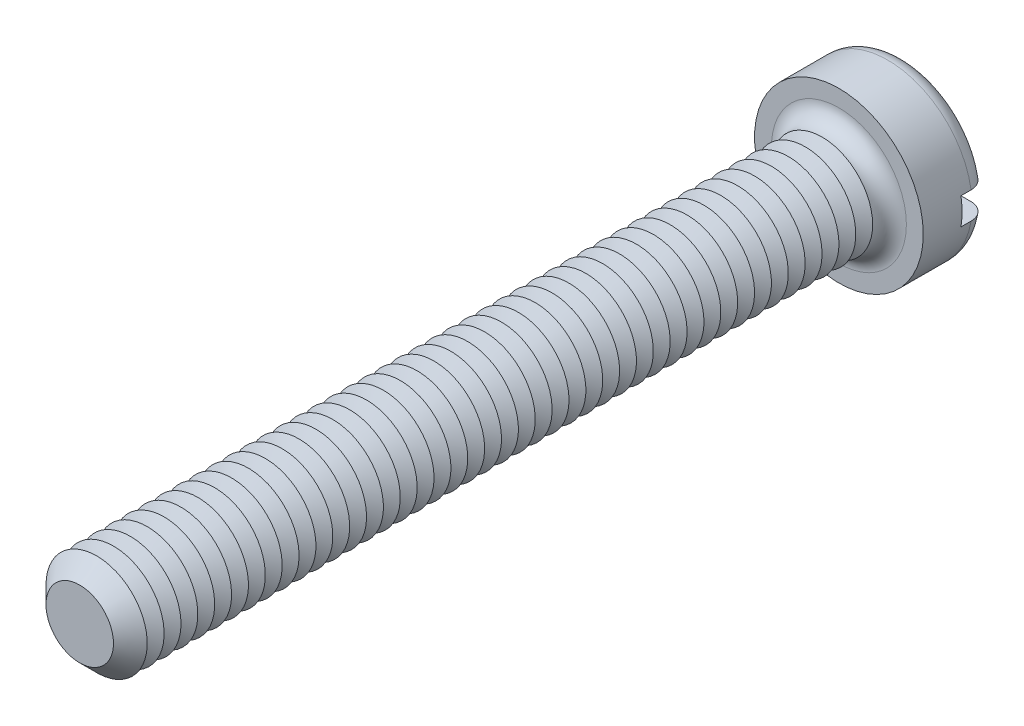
ISO-10303-21;
HEADER;
FILE_DESCRIPTION(('STEP AP214'),'2;1');
FILE_NAME('part.step','',(''),(''),'','','');
FILE_SCHEMA(('AUTOMOTIVE_DESIGN { 1 0 10303 214 1 1 1 1 }'));
ENDSEC;
DATA;
#1=APPLICATION_CONTEXT('core data for automotive mechanical design processes');
#2=APPLICATION_PROTOCOL_DEFINITION('international standard','automotive_design',2000,#1);
#3=PRODUCT_CONTEXT('',#1,'mechanical');
#4=PRODUCT('Part','Part','',(#3));
#5=PRODUCT_RELATED_PRODUCT_CATEGORY('part','',(#4));
#6=PRODUCT_DEFINITION_FORMATION('','',#4);
#7=PRODUCT_DEFINITION_CONTEXT('part definition',#1,'design');
#8=PRODUCT_DEFINITION('design','',#6,#7);
#9=PRODUCT_DEFINITION_SHAPE('','',#8);
#10=(LENGTH_UNIT() NAMED_UNIT(*) SI_UNIT(.MILLI.,.METRE.));
#11=(NAMED_UNIT(*) PLANE_ANGLE_UNIT() SI_UNIT($,.RADIAN.));
#12=(NAMED_UNIT(*) SI_UNIT($,.STERADIAN.) SOLID_ANGLE_UNIT());
#13=UNCERTAINTY_MEASURE_WITH_UNIT(LENGTH_MEASURE(1.E-05),#10,'distance_accuracy_value','');
#14=(GEOMETRIC_REPRESENTATION_CONTEXT(3) GLOBAL_UNCERTAINTY_ASSIGNED_CONTEXT((#13)) GLOBAL_UNIT_ASSIGNED_CONTEXT((#10,
#11,#12)) REPRESENTATION_CONTEXT('',''));
#15=CARTESIAN_POINT('',(0.,0.,0.));
#16=DIRECTION('',(0.,0.,1.));
#17=DIRECTION('',(1.,0.,0.));
#18=AXIS2_PLACEMENT_3D('',#15,#16,#17);
#19=CARTESIAN_POINT('',(0.,0.,-3.9));
#20=DIRECTION('',(0.,0.,1.));
#21=DIRECTION('',(1.,0.,0.));
#22=AXIS2_PLACEMENT_3D('',#19,#20,#21);
#23=PLANE('',#22);
#24=CARTESIAN_POINT('',(0.,0.,-3.9));
#25=DIRECTION('',(0.,0.,1.));
#26=DIRECTION('',(1.,0.,0.));
#27=AXIS2_PLACEMENT_3D('',#24,#25,#26);
#28=CIRCLE('',#27,4.);
#29=CARTESIAN_POINT('',(-3.91918358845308,0.800000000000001,-3.9));
#30=VERTEX_POINT('',#29);
#31=CARTESIAN_POINT('',(3.91918358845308,0.8,-3.9));
#32=VERTEX_POINT('',#31);
#33=EDGE_CURVE('E116',#30,#32,#28,.F.);
#34=ORIENTED_EDGE('',*,*,#33,.T.);
#35=DIRECTION('',(1.,0.,0.));
#36=VECTOR('',#35,1.);
#37=CARTESIAN_POINT('',(-5.,0.800000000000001,-3.9));
#38=LINE('',#37,#36);
#39=EDGE_CURVE('E111',#30,#32,#38,.T.);
#40=ORIENTED_EDGE('',*,*,#39,.F.);
#41=EDGE_LOOP('',(#34,#40));
#42=FACE_BOUND('',#41,.T.);
#43=ADVANCED_FACE('F39',(#42),#23,.F.);
#44=CARTESIAN_POINT('',(0.,0.,-2.9));
#45=DIRECTION('',(0.,0.,1.));
#46=DIRECTION('',(1.,0.,0.));
#47=AXIS2_PLACEMENT_3D('',#44,#45,#46);
#48=TOROIDAL_SURFACE('',#47,4.,1.);
#49=CARTESIAN_POINT('',(-4.76648512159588,0.800000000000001,-3.45304061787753));
#50=CARTESIAN_POINT('',(-4.73486405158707,0.800000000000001,-3.50001565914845));
#51=CARTESIAN_POINT('',(-4.69920787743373,0.800000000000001,-3.54432871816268));
#52=CARTESIAN_POINT('',(-4.62090302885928,0.800000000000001,-3.62634638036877));
#53=CARTESIAN_POINT('',(-4.57824494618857,0.800000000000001,-3.66404194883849));
#54=CARTESIAN_POINT('',(-4.48726975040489,0.800000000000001,-3.73172278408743));
#55=CARTESIAN_POINT('',(-4.43895902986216,0.800000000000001,-3.76171664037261));
#56=CARTESIAN_POINT('',(-4.33804923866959,0.800000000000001,-3.81326437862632));
#57=CARTESIAN_POINT('',(-4.2854512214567,0.800000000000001,-3.8348203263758));
#58=CARTESIAN_POINT('',(-4.17679895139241,0.800000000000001,-3.86918431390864));
#59=CARTESIAN_POINT('',(-4.12071163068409,0.800000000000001,-3.88188775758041));
#60=CARTESIAN_POINT('',(-4.00720729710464,0.800000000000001,-3.89785932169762));
#61=CARTESIAN_POINT('',(-3.94979011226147,0.800000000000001,-3.9011262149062));
#62=CARTESIAN_POINT('',(-3.83429042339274,0.800000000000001,-3.89816676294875));
#63=CARTESIAN_POINT('',(-3.77621176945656,0.800000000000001,-3.89178937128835));
#64=CARTESIAN_POINT('',(-3.66191938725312,0.800000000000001,-3.8694726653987));
#65=CARTESIAN_POINT('',(-3.60570580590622,0.800000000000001,-3.85353259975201));
#66=CARTESIAN_POINT('',(-3.49618749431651,0.800000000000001,-3.81233202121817));
#67=CARTESIAN_POINT('',(-3.44291561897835,0.800000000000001,-3.78698406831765));
#68=CARTESIAN_POINT('',(-3.34140774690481,0.800000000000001,-3.72766098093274));
#69=CARTESIAN_POINT('',(-3.29317182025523,0.800000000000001,-3.69368572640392));
#70=CARTESIAN_POINT('',(-3.20343355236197,0.800000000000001,-3.6182054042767));
#71=CARTESIAN_POINT('',(-3.16189680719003,0.800000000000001,-3.57674128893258));
#72=CARTESIAN_POINT('',(-3.08658236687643,0.800000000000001,-3.48727547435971));
#73=CARTESIAN_POINT('',(-3.05280364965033,0.800000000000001,-3.43927463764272));
#74=CARTESIAN_POINT('',(-2.99489532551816,0.800000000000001,-3.33932895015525));
#75=CARTESIAN_POINT('',(-2.97055012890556,0.800000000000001,-3.28750911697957));
#76=CARTESIAN_POINT('',(-2.93124252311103,0.800000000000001,-3.18042600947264));
#77=CARTESIAN_POINT('',(-2.91627793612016,0.800000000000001,-3.12516353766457));
#78=CARTESIAN_POINT('',(-2.89663075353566,0.800000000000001,-3.01470560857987));
#79=CARTESIAN_POINT('',(-2.89162828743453,0.800000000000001,-2.95956691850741));
#80=CARTESIAN_POINT('',(-2.89112479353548,0.800000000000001,-2.84924961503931));
#81=CARTESIAN_POINT('',(-2.89562264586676,0.800000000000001,-2.79407100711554));
#82=CARTESIAN_POINT('',(-2.91379565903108,0.800000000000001,-2.6861912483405));
#83=CARTESIAN_POINT('',(-2.92731815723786,0.800000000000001,-2.63346424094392));
#84=CARTESIAN_POINT('',(-2.96290888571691,0.800000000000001,-2.53098203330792));
#85=CARTESIAN_POINT('',(-2.98497757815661,0.800000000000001,-2.48122699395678));
#86=CARTESIAN_POINT('',(-3.03728055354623,0.800000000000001,-2.38535286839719));
#87=CARTESIAN_POINT('',(-3.06761989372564,0.800000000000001,-2.33929117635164));
#88=CARTESIAN_POINT('',(-3.13537950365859,0.800000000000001,-2.2527125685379));
#89=CARTESIAN_POINT('',(-3.17280082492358,0.800000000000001,-2.21219647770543));
#90=CARTESIAN_POINT('',(-3.2549164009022,0.800000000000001,-2.13651195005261));
#91=CARTESIAN_POINT('',(-3.29980186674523,0.800000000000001,-2.10155095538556));
#92=CARTESIAN_POINT('',(-3.39467666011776,0.800000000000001,-2.03942270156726));
#93=CARTESIAN_POINT('',(-3.44466673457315,0.800000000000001,-2.01225658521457));
#94=CARTESIAN_POINT('',(-3.5497933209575,0.800000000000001,-1.96576935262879));
#95=CARTESIAN_POINT('',(-3.60503228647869,0.800000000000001,-1.94667963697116));
#96=CARTESIAN_POINT('',(-3.71791613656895,0.800000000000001,-1.91794308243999));
#97=CARTESIAN_POINT('',(-3.77556119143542,0.800000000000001,-1.90829691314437));
#98=CARTESIAN_POINT('',(-3.89221522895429,0.800000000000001,-1.89869331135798));
#99=CARTESIAN_POINT('',(-3.9512319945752,0.800000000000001,-1.89882985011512));
#100=CARTESIAN_POINT('',(-4.06839541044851,0.800000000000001,-1.90907818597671));
#101=CARTESIAN_POINT('',(-4.12654207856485,0.800000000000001,-1.91918977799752));
#102=CARTESIAN_POINT('',(-4.23988103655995,0.800000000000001,-1.9490667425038));
#103=CARTESIAN_POINT('',(-4.29509069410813,0.800000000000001,-1.96876615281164));
#104=CARTESIAN_POINT('',(-4.40134194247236,0.800000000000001,-2.01729572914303));
#105=CARTESIAN_POINT('',(-4.45238383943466,0.800000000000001,-2.04612522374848));
#106=CARTESIAN_POINT('',(-4.54801343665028,0.800000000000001,-2.1116316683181));
#107=CARTESIAN_POINT('',(-4.59268768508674,0.800000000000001,-2.14818225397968));
#108=CARTESIAN_POINT('',(-4.67513924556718,0.800000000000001,-2.22837632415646));
#109=CARTESIAN_POINT('',(-4.71291715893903,0.800000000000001,-2.27201918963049));
#110=CARTESIAN_POINT('',(-4.77986554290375,0.800000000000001,-2.36439990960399));
#111=CARTESIAN_POINT('',(-4.80916462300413,0.800000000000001,-2.41304457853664));
#112=CARTESIAN_POINT('',(-4.85906149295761,0.800000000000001,-2.51460659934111));
#113=CARTESIAN_POINT('',(-4.8796602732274,0.800000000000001,-2.56752346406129));
#114=CARTESIAN_POINT('',(-4.9113264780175,0.800000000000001,-2.67542592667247));
#115=CARTESIAN_POINT('',(-4.92250819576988,0.800000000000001,-2.73037800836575));
#116=CARTESIAN_POINT('',(-4.93542682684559,0.800000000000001,-2.84139649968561));
#117=CARTESIAN_POINT('',(-4.93716171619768,0.800000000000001,-2.89746314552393));
#118=CARTESIAN_POINT('',(-4.93114851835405,0.800000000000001,-3.00876455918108));
#119=CARTESIAN_POINT('',(-4.92345325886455,0.800000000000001,-3.0640022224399));
#120=CARTESIAN_POINT('',(-4.8989032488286,0.800000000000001,-3.17235240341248));
#121=CARTESIAN_POINT('',(-4.88205998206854,0.800000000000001,-3.22546749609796));
#122=CARTESIAN_POINT('',(-4.84819200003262,0.800000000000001,-3.30764066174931));
#123=CARTESIAN_POINT('',(-4.83390853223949,0.800000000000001,-3.33785845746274));
#124=CARTESIAN_POINT('',(-4.80237957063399,0.800000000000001,-3.39670633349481));
#125=CARTESIAN_POINT('',(-4.78513409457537,0.800000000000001,-3.42533642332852));
#126=CARTESIAN_POINT('',(-4.76648512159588,0.800000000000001,-3.45304061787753));
#127=B_SPLINE_CURVE_WITH_KNOTS('',3,(#49,#50,#51,#52,#53,#54,#55,#56,#57,#58,#59,#60,#61,#62,
#63,#64,#65,#66,#67,#68,#69,#70,#71,#72,#73,#74,#75,#76,#77,#78,#79,#80,#81,#82,#83,#84,#85,#86,
#87,#88,#89,#90,#91,#92,#93,#94,#95,#96,#97,#98,#99,#100,#101,#102,#103,#104,#105,#106,#107,
#108,#109,#110,#111,#112,#113,#114,#115,#116,#117,#118,#119,#120,#121,#122,#123,#124,#125,#126),
.UNSPECIFIED.,.T.,.F.,(4,2,2,2,2,2,2,2,2,2,2,2,2,2,2,2,2,2,2,2,2,2,2,2,2,2,2,2,2,2,2,2,2,2,2,2,
2,2,4),(0.,0.169755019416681,0.339740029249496,0.509534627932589,0.67928763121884,
0.851013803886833,1.02276230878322,1.19722869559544,1.37170879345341,1.54785292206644,
1.72399950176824,1.89921049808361,2.07439839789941,2.24530597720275,2.41617386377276,
2.58146078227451,2.74672821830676,2.90926852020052,3.0718176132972,3.2365363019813,
3.40127946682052,3.57118676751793,3.74111896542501,3.91563534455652,4.09016409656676,
4.26636956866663,4.4425714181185,4.61757781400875,4.79257134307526,4.96489650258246,
5.13720662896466,5.30674670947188,5.47626748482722,5.64369988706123,5.81116816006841,
5.97770254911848,6.14402836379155,6.24414438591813,6.34425980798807),.UNSPECIFIED.);
#128=CARTESIAN_POINT('',(-4.93558507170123,0.800000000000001,-2.9));
#129=VERTEX_POINT('',#128);
#130=EDGE_CURVE('E522',#129,#30,#127,.T.);
#131=ORIENTED_EDGE('',*,*,#130,.F.);
#132=CARTESIAN_POINT('',(0.,0.,-2.9));
#133=DIRECTION('',(0.,0.,1.));
#134=DIRECTION('',(1.,0.,0.));
#135=AXIS2_PLACEMENT_3D('',#132,#133,#134);
#136=CIRCLE('',#135,5.);
#137=CARTESIAN_POINT('',(4.93558507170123,0.8,-2.9));
#138=VERTEX_POINT('',#137);
#139=EDGE_CURVE('E124',#138,#129,#136,.T.);
#140=ORIENTED_EDGE('',*,*,#139,.F.);
#141=CARTESIAN_POINT('',(2.98553785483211,0.8,-3.31649797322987));
#142=CARTESIAN_POINT('',(3.00991125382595,0.8,-3.36788093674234));
#143=CARTESIAN_POINT('',(3.03875556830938,0.8,-3.41719756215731));
#144=CARTESIAN_POINT('',(3.1043993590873,0.8,-3.51028676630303));
#145=CARTESIAN_POINT('',(3.1412115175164,0.8,-3.55405032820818));
#146=CARTESIAN_POINT('',(3.22153641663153,0.8,-3.63476402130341));
#147=CARTESIAN_POINT('',(3.26503706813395,0.8,-3.67172618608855));
#148=CARTESIAN_POINT('',(3.35749627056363,0.8,-3.73799476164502));
#149=CARTESIAN_POINT('',(3.4064533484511,0.8,-3.76730323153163));
#150=CARTESIAN_POINT('',(3.5095773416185,0.8,-3.81809642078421));
#151=CARTESIAN_POINT('',(3.56383317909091,0.8,-3.83940072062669));
#152=CARTESIAN_POINT('',(3.67513017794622,0.8,-3.87272481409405));
#153=CARTESIAN_POINT('',(3.7321717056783,0.8,-3.88474338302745));
#154=CARTESIAN_POINT('',(3.84815688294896,0.8,-3.89923413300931));
#155=CARTESIAN_POINT('',(3.90711516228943,0.8,-3.9015896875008));
#156=CARTESIAN_POINT('',(4.02458610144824,0.8,-3.89631753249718));
#157=CARTESIAN_POINT('',(4.08309876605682,0.8,-3.8886899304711));
#158=CARTESIAN_POINT('',(4.19768646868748,0.8,-3.86366584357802));
#159=CARTESIAN_POINT('',(4.25377243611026,0.8,-3.84631948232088));
#160=CARTESIAN_POINT('',(4.3621676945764,0.8,-3.80231797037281));
#161=CARTESIAN_POINT('',(4.41447726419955,0.8,-3.77566350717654));
#162=CARTESIAN_POINT('',(4.51300872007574,0.8,-3.71421163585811));
#163=CARTESIAN_POINT('',(4.5593085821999,0.8,-3.67953927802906));
#164=CARTESIAN_POINT('',(4.64530675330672,0.8,-3.60279495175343));
#165=CARTESIAN_POINT('',(4.68500564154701,0.8,-3.56072363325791));
#166=CARTESIAN_POINT('',(4.75599202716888,0.8,-3.47111750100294));
#167=CARTESIAN_POINT('',(4.7874061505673,0.8,-3.42368298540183));
#168=CARTESIAN_POINT('',(4.84170328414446,0.8,-3.32415927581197));
#169=CARTESIAN_POINT('',(4.86458695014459,0.8,-3.2720704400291));
#170=CARTESIAN_POINT('',(4.90088120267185,0.8,-3.16544016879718));
#171=CARTESIAN_POINT('',(4.91440984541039,0.8,-3.11093889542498));
#172=CARTESIAN_POINT('',(4.93205429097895,0.8,-3.00043391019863));
#173=CARTESIAN_POINT('',(4.93617053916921,0.8,-2.9444302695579));
#174=CARTESIAN_POINT('',(4.93486973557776,0.8,-2.83292218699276));
#175=CARTESIAN_POINT('',(4.92951827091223,0.8,-2.77741696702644));
#176=CARTESIAN_POINT('',(4.90957104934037,0.8,-2.66809456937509));
#177=CARTESIAN_POINT('',(4.89497541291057,0.8,-2.61427736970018));
#178=CARTESIAN_POINT('',(4.85697876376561,0.8,-2.50985095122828));
#179=CARTESIAN_POINT('',(4.83357805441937,0.8,-2.45924162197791));
#180=CARTESIAN_POINT('',(4.77866660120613,0.8,-2.36263484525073));
#181=CARTESIAN_POINT('',(4.74715567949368,0.8,-2.31663749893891));
#182=CARTESIAN_POINT('',(4.67670791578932,0.8,-2.23021464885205));
#183=CARTESIAN_POINT('',(4.6377224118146,0.8,-2.1898288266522));
#184=CARTESIAN_POINT('',(4.55359880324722,0.8,-2.11607828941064));
#185=CARTESIAN_POINT('',(4.50846036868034,0.8,-2.08271395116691));
#186=CARTESIAN_POINT('',(4.41271544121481,0.8,-2.02349513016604));
#187=CARTESIAN_POINT('',(4.36204749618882,0.8,-1.99774003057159));
#188=CARTESIAN_POINT('',(4.257155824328,0.8,-1.95495040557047));
#189=CARTESIAN_POINT('',(4.20293181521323,0.8,-1.93791657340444));
#190=CARTESIAN_POINT('',(4.09154156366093,0.8,-1.91276335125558));
#191=CARTESIAN_POINT('',(4.03434212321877,0.8,-1.90479098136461));
#192=CARTESIAN_POINT('',(3.91941228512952,0.8,-1.89840884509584));
#193=CARTESIAN_POINT('',(3.8616818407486,0.8,-1.89999992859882));
#194=CARTESIAN_POINT('',(3.7464111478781,0.8,-1.91275144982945));
#195=CARTESIAN_POINT('',(3.6888866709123,0.8,-1.92405471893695));
#196=CARTESIAN_POINT('',(3.57652290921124,0.8,-1.95609086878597));
#197=CARTESIAN_POINT('',(3.52168382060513,0.8,-1.97682443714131));
#198=CARTESIAN_POINT('',(3.41589179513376,0.8,-2.02733294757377));
#199=CARTESIAN_POINT('',(3.36496676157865,0.8,-2.05716640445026));
#200=CARTESIAN_POINT('',(3.26890903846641,0.8,-2.12504079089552));
#201=CARTESIAN_POINT('',(3.22377627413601,0.8,-2.16308161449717));
#202=CARTESIAN_POINT('',(3.141135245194,0.8,-2.24593284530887));
#203=CARTESIAN_POINT('',(3.1035541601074,0.8,-2.29067053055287));
#204=CARTESIAN_POINT('',(3.03669700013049,0.8,-2.38597317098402));
#205=CARTESIAN_POINT('',(3.00741914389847,0.8,-2.43653687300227));
#206=CARTESIAN_POINT('',(2.95891799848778,0.8,-2.54052959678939));
#207=CARTESIAN_POINT('',(2.93943249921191,0.8,-2.59383627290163));
#208=CARTESIAN_POINT('',(2.9100081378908,0.8,-2.70303736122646));
#209=CARTESIAN_POINT('',(2.90006970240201,0.8,-2.75893188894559));
#210=CARTESIAN_POINT('',(2.89027863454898,0.8,-2.86986958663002));
#211=CARTESIAN_POINT('',(2.89012791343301,0.8,-2.92488680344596));
#212=CARTESIAN_POINT('',(2.89917145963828,0.8,-3.03409648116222));
#213=CARTESIAN_POINT('',(2.90835313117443,0.8,-3.08828995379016));
#214=CARTESIAN_POINT('',(2.92977618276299,0.8,-3.17141652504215));
#215=CARTESIAN_POINT('',(2.93899011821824,0.8,-3.20116372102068));
#216=CARTESIAN_POINT('',(2.96020249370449,0.8,-3.25964614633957));
#217=CARTESIAN_POINT('',(2.97220082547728,0.8,-3.28838141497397));
#218=CARTESIAN_POINT('',(2.98553785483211,0.8,-3.31649797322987));
#219=B_SPLINE_CURVE_WITH_KNOTS('',3,(#141,#142,#143,#144,#145,#146,#147,#148,#149,#150,#151,
#152,#153,#154,#155,#156,#157,#158,#159,#160,#161,#162,#163,#164,#165,#166,#167,#168,#169,#170,
#171,#172,#173,#174,#175,#176,#177,#178,#179,#180,#181,#182,#183,#184,#185,#186,#187,#188,#189,
#190,#191,#192,#193,#194,#195,#196,#197,#198,#199,#200,#201,#202,#203,#204,#205,#206,#207,#208,
#209,#210,#211,#212,#213,#214,#215,#216,#217,#218),.UNSPECIFIED.,.T.,.F.,(4,2,2,2,2,2,2,2,2,2,2,
2,2,2,2,2,2,2,2,2,2,2,2,2,2,2,2,2,2,2,2,2,2,2,2,2,2,2,4),(0.,0.170493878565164,
0.341261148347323,0.511723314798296,0.682139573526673,0.856194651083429,1.03027268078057,
1.20644565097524,1.38261672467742,1.55788746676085,1.73314526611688,1.90583484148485,
2.07850925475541,2.24836742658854,2.41821253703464,2.58587311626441,2.75352576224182,
2.92002154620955,3.08651516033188,3.25300303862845,3.41949456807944,3.58710926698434,
3.75473295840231,3.92445790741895,4.09419634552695,4.26665110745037,4.43912119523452,
4.61417197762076,4.78923552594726,4.96544940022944,5.1416609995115,5.31608191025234,
5.49046537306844,5.65989063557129,5.82932346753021,5.99359365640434,6.157642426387,
6.250939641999,6.34423323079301),.UNSPECIFIED.);
#220=EDGE_CURVE('E524',#32,#138,#219,.T.);
#221=ORIENTED_EDGE('',*,*,#220,.F.);
#222=ORIENTED_EDGE('',*,*,#33,.F.);
#223=EDGE_LOOP('',(#131,#140,#221,#222));
#224=FACE_BOUND('',#223,.T.);
#225=ADVANCED_FACE('F506',(#224),#48,.T.);
#226=CARTESIAN_POINT('',(0.,0.,-3.9));
#227=DIRECTION('',(0.,0.,1.));
#228=DIRECTION('',(1.,0.,0.));
#229=AXIS2_PLACEMENT_3D('',#226,#227,#228);
#230=CYLINDRICAL_SURFACE('',#229,5.);
#231=DIRECTION('',(0.,0.,1.));
#232=VECTOR('',#231,1.);
#233=CARTESIAN_POINT('',(4.93558507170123,0.8,-3.9));
#234=LINE('',#233,#232);
#235=CARTESIAN_POINT('',(4.93558507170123,0.8,-2.3));
#236=VERTEX_POINT('',#235);
#237=EDGE_CURVE('E540',#138,#236,#234,.T.);
#238=ORIENTED_EDGE('',*,*,#237,.F.);
#239=ORIENTED_EDGE('',*,*,#139,.T.);
#240=DIRECTION('',(0.,0.,1.));
#241=VECTOR('',#240,1.);
#242=CARTESIAN_POINT('',(-4.93558507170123,0.800000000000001,-3.9));
#243=LINE('',#242,#241);
#244=CARTESIAN_POINT('',(-4.93558507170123,0.800000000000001,-2.3));
#245=VERTEX_POINT('',#244);
#246=EDGE_CURVE('E63',#245,#129,#243,.F.);
#247=ORIENTED_EDGE('',*,*,#246,.F.);
#248=CARTESIAN_POINT('',(0.,0.,-2.3));
#249=DIRECTION('',(0.,0.,-1.));
#250=DIRECTION('',(-1.,0.,0.));
#251=AXIS2_PLACEMENT_3D('',#248,#249,#250);
#252=CIRCLE('',#251,5.);
#253=CARTESIAN_POINT('',(-4.93558507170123,-0.799999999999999,-2.3));
#254=VERTEX_POINT('',#253);
#255=EDGE_CURVE('E43',#245,#254,#252,.F.);
#256=ORIENTED_EDGE('',*,*,#255,.T.);
#257=DIRECTION('',(0.,0.,1.));
#258=VECTOR('',#257,1.);
#259=CARTESIAN_POINT('',(-4.93558507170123,-0.799999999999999,-3.9));
#260=LINE('',#259,#258);
#261=CARTESIAN_POINT('',(-4.93558507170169,-0.799999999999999,-2.89999999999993));
#262=VERTEX_POINT('',#261);
#263=EDGE_CURVE('E537',#262,#254,#260,.T.);
#264=ORIENTED_EDGE('',*,*,#263,.F.);
#265=CARTESIAN_POINT('',(4.93558507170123,-0.8,-2.9));
#266=VERTEX_POINT('',#265);
#267=EDGE_CURVE('E126',#262,#266,#136,.T.);
#268=ORIENTED_EDGE('',*,*,#267,.T.);
#269=DIRECTION('',(0.,0.,1.));
#270=VECTOR('',#269,1.);
#271=CARTESIAN_POINT('',(4.93558507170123,-0.8,-3.9));
#272=LINE('',#271,#270);
#273=CARTESIAN_POINT('',(4.93558507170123,-0.8,-2.3));
#274=VERTEX_POINT('',#273);
#275=EDGE_CURVE('E55',#274,#266,#272,.F.);
#276=ORIENTED_EDGE('',*,*,#275,.F.);
#277=EDGE_CURVE('E11',#274,#236,#252,.F.);
#278=ORIENTED_EDGE('',*,*,#277,.T.);
#279=EDGE_LOOP('',(#238,#239,#247,#256,#264,#268,#276,#278));
#280=FACE_BOUND('',#279,.T.);
#281=CARTESIAN_POINT('',(0.,0.,0.));
#282=DIRECTION('',(0.,0.,1.));
#283=DIRECTION('',(1.,0.,0.));
#284=AXIS2_PLACEMENT_3D('',#281,#282,#283);
#285=CIRCLE('',#284,5.);
#286=CARTESIAN_POINT('',(5.,0.,0.));
#287=VERTEX_POINT('',#286);
#288=EDGE_CURVE('E543',#287,#287,#285,.T.);
#289=ORIENTED_EDGE('',*,*,#288,.F.);
#290=EDGE_LOOP('',(#289));
#291=FACE_BOUND('',#290,.T.);
#292=ADVANCED_FACE('F502',(#280,#291),#230,.T.);
#293=CARTESIAN_POINT('',(3.91918358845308,-0.8,-3.9));
#294=VERTEX_POINT('',#293);
#295=CARTESIAN_POINT('',(-3.91918358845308,-0.799999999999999,-3.9));
#296=VERTEX_POINT('',#295);
#297=EDGE_CURVE('E109',#294,#296,#28,.F.);
#298=ORIENTED_EDGE('',*,*,#297,.T.);
#299=DIRECTION('',(-1.,0.,0.));
#300=VECTOR('',#299,1.);
#301=CARTESIAN_POINT('',(-5.,-0.799999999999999,-3.9));
#302=LINE('',#301,#300);
#303=EDGE_CURVE('E96',#294,#296,#302,.T.);
#304=ORIENTED_EDGE('',*,*,#303,.F.);
#305=EDGE_LOOP('',(#298,#304));
#306=FACE_BOUND('',#305,.T.);
#307=ADVANCED_FACE('F108',(#306),#23,.F.);
#308=CARTESIAN_POINT('',(0.,0.,0.));
#309=DIRECTION('',(0.,0.,1.));
#310=DIRECTION('',(1.,0.,0.));
#311=AXIS2_PLACEMENT_3D('',#308,#309,#310);
#312=PLANE('',#311);
#313=CARTESIAN_POINT('',(0.,0.,0.));
#314=DIRECTION('',(0.,0.,1.));
#315=DIRECTION('',(1.,0.,0.));
#316=AXIS2_PLACEMENT_3D('',#313,#314,#315);
#317=CIRCLE('',#316,4.);
#318=CARTESIAN_POINT('',(4.,0.,0.));
#319=VERTEX_POINT('',#318);
#320=EDGE_CURVE('E115',#319,#319,#317,.F.);
#321=ORIENTED_EDGE('',*,*,#320,.T.);
#322=EDGE_LOOP('',(#321));
#323=FACE_BOUND('',#322,.T.);
#324=ORIENTED_EDGE('',*,*,#288,.T.);
#325=EDGE_LOOP('',(#324));
#326=FACE_BOUND('',#325,.T.);
#327=ADVANCED_FACE('F501',(#323,#326),#312,.T.);
#328=CARTESIAN_POINT('',(-4.76648512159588,-0.799999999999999,-3.45304061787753));
#329=CARTESIAN_POINT('',(-4.7975694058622,-0.799999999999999,-3.40685392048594));
#330=CARTESIAN_POINT('',(-4.82479903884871,-0.799999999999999,-3.35802740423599));
#331=CARTESIAN_POINT('',(-4.87070632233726,-0.799999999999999,-3.25646127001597));
#332=CARTESIAN_POINT('',(-4.8893747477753,-0.799999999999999,-3.20371750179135));
#333=CARTESIAN_POINT('',(-4.91756720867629,-0.799999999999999,-3.09584501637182));
#334=CARTESIAN_POINT('',(-4.92709302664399,-0.799999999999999,-3.04071676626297));
#335=CARTESIAN_POINT('',(-4.93671217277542,-0.799999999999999,-2.92965669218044));
#336=CARTESIAN_POINT('',(-4.93680767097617,-0.799999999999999,-2.87372505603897));
#337=CARTESIAN_POINT('',(-4.92758675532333,-0.799999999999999,-2.76284675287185));
#338=CARTESIAN_POINT('',(-4.91830421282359,-0.799999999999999,-2.70789726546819));
#339=CARTESIAN_POINT('',(-4.89065741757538,-0.799999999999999,-2.60033228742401));
#340=CARTESIAN_POINT('',(-4.87229291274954,-0.799999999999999,-2.54771686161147));
#341=CARTESIAN_POINT('',(-4.82699855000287,-0.799999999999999,-2.44622441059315));
#342=CARTESIAN_POINT('',(-4.80005659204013,-0.799999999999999,-2.39735278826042));
#343=CARTESIAN_POINT('',(-4.73841244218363,-0.799999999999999,-2.30477947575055));
#344=CARTESIAN_POINT('',(-4.70371003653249,-0.799999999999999,-2.26107792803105));
#345=CARTESIAN_POINT('',(-4.62724516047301,-0.799999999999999,-2.17969334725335));
#346=CARTESIAN_POINT('',(-4.58542787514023,-0.799999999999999,-2.14206183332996));
#347=CARTESIAN_POINT('',(-4.49614171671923,-0.799999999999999,-2.07424284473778));
#348=CARTESIAN_POINT('',(-4.44867251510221,-0.799999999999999,-2.04405580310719));
#349=CARTESIAN_POINT('',(-4.34875035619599,-0.799999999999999,-1.99153688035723));
#350=CARTESIAN_POINT('',(-4.29623870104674,-0.799999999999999,-1.96931670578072));
#351=CARTESIAN_POINT('',(-4.18826905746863,-0.799999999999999,-1.93384994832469));
#352=CARTESIAN_POINT('',(-4.1328108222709,-0.799999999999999,-1.92060411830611));
#353=CARTESIAN_POINT('',(-4.01956054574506,-0.799999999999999,-1.90323798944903));
#354=CARTESIAN_POINT('',(-3.96174522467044,-0.799999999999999,-1.89926947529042));
#355=CARTESIAN_POINT('',(-3.84625419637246,-0.799999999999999,-1.90095183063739));
#356=CARTESIAN_POINT('',(-3.78857850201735,-0.799999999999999,-1.90660355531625));
#357=CARTESIAN_POINT('',(-3.67415602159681,-0.799999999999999,-1.92748272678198));
#358=CARTESIAN_POINT('',(-3.61743328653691,-0.799999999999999,-1.94284216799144));
#359=CARTESIAN_POINT('',(-3.50734962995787,-0.799999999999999,-1.9828275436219));
#360=CARTESIAN_POINT('',(-3.4539889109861,-0.799999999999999,-2.00745403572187));
#361=CARTESIAN_POINT('',(-3.35197118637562,-0.799999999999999,-2.06542964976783));
#362=CARTESIAN_POINT('',(-3.30333217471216,-0.799999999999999,-2.0988104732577));
#363=CARTESIAN_POINT('',(-3.21244692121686,-0.799999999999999,-2.17337326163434));
#364=CARTESIAN_POINT('',(-3.17020039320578,-0.799999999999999,-2.21455487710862));
#365=CARTESIAN_POINT('',(-3.0940098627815,-0.799999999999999,-2.30296695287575));
#366=CARTESIAN_POINT('',(-3.05995540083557,-0.799999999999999,-2.35010211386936));
#367=CARTESIAN_POINT('',(-3.00053815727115,-0.799999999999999,-2.4495670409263));
#368=CARTESIAN_POINT('',(-2.97517362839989,-0.799999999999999,-2.50189576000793));
#369=CARTESIAN_POINT('',(-2.93470320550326,-0.799999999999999,-2.60853979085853));
#370=CARTESIAN_POINT('',(-2.91930557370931,-0.799999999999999,-2.66274437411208));
#371=CARTESIAN_POINT('',(-2.89812734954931,-0.799999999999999,-2.77299836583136));
#372=CARTESIAN_POINT('',(-2.89234481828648,-0.799999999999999,-2.82904740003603));
#373=CARTESIAN_POINT('',(-2.89064073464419,-0.799999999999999,-2.93970612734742));
#374=CARTESIAN_POINT('',(-2.89444549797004,-0.799999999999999,-2.99431180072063));
#375=CARTESIAN_POINT('',(-2.9112006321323,-0.799999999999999,-3.10209766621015));
#376=CARTESIAN_POINT('',(-2.9241507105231,-0.799999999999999,-3.1552779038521));
#377=CARTESIAN_POINT('',(-2.95868580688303,-0.799999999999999,-3.25858631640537));
#378=CARTESIAN_POINT('',(-2.98024709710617,-0.799999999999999,-3.30872244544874));
#379=CARTESIAN_POINT('',(-3.03128544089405,-0.799999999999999,-3.40478519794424));
#380=CARTESIAN_POINT('',(-3.06076335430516,-0.799999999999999,-3.45071136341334));
#381=CARTESIAN_POINT('',(-3.12753448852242,-0.799999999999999,-3.53826932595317));
#382=CARTESIAN_POINT('',(-3.16500083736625,-0.799999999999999,-3.57976901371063));
#383=CARTESIAN_POINT('',(-3.24617503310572,-0.799999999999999,-3.65613204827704));
#384=CARTESIAN_POINT('',(-3.28988388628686,-0.799999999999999,-3.69099432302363));
#385=CARTESIAN_POINT('',(-3.38380639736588,-0.799999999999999,-3.75424083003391));
#386=CARTESIAN_POINT('',(-3.43418287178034,-0.799999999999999,-3.78238342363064));
#387=CARTESIAN_POINT('',(-3.53887888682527,-0.799999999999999,-3.83000231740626));
#388=CARTESIAN_POINT('',(-3.59319889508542,-0.799999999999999,-3.84947758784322));
#389=CARTESIAN_POINT('',(-3.70539237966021,-0.799999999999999,-3.87954336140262));
#390=CARTESIAN_POINT('',(-3.76331464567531,-0.799999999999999,-3.88995217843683));
#391=CARTESIAN_POINT('',(-3.88008461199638,-0.799999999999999,-3.9009132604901));
#392=CARTESIAN_POINT('',(-3.93893230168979,-0.799999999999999,-3.9014656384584));
#393=CARTESIAN_POINT('',(-4.05594892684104,-0.799999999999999,-3.89264187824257));
#394=CARTESIAN_POINT('',(-4.11411702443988,-0.799999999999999,-3.88325457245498));
#395=CARTESIAN_POINT('',(-4.22802928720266,-0.799999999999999,-3.85472582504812));
#396=CARTESIAN_POINT('',(-4.28377297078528,-0.799999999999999,-3.83558245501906));
#397=CARTESIAN_POINT('',(-4.39054463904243,-0.799999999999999,-3.78829842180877));
#398=CARTESIAN_POINT('',(-4.44161887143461,-0.799999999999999,-3.76026208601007));
#399=CARTESIAN_POINT('',(-4.53818016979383,-0.799999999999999,-3.69589278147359));
#400=CARTESIAN_POINT('',(-4.58367442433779,-0.799999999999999,-3.65957066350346));
#401=CARTESIAN_POINT('',(-4.65208830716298,-0.799999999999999,-3.59453310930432));
#402=CARTESIAN_POINT('',(-4.67711825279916,-0.799999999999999,-3.56800018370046));
#403=CARTESIAN_POINT('',(-4.72414423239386,-0.799999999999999,-3.51236863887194));
#404=CARTESIAN_POINT('',(-4.74614029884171,-0.799999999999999,-3.48327004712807));
#405=CARTESIAN_POINT('',(-4.76648512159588,-0.799999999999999,-3.45304061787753));
#406=B_SPLINE_CURVE_WITH_KNOTS('',3,(#328,#329,#330,#331,#332,#333,#334,#335,#336,#337,#338,
#339,#340,#341,#342,#343,#344,#345,#346,#347,#348,#349,#350,#351,#352,#353,#354,#355,#356,#357,
#358,#359,#360,#361,#362,#363,#364,#365,#366,#367,#368,#369,#370,#371,#372,#373,#374,#375,#376,
#377,#378,#379,#380,#381,#382,#383,#384,#385,#386,#387,#388,#389,#390,#391,#392,#393,#394,#395,
#396,#397,#398,#399,#400,#401,#402,#403,#404,#405),.UNSPECIFIED.,.T.,.F.,(4,2,2,2,2,2,2,2,2,2,2,
2,2,2,2,2,2,2,2,2,2,2,2,2,2,2,2,2,2,2,2,2,2,2,2,2,2,2,4),(0.,0.166886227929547,
0.333951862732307,0.500984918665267,0.667979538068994,0.834373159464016,1.00077139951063,
1.16740542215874,1.33404403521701,1.50202999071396,1.67002571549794,1.84029248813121,
2.01057354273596,2.18362161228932,2.35668506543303,2.53215380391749,2.70763310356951,
2.88375684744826,3.05987270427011,3.23346085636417,3.40701408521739,3.57522519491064,
3.74340238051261,3.90683338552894,4.0702591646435,4.23323770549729,4.39623395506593,
4.56320691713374,4.7302068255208,4.90252468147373,5.07486300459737,5.25058028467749,
5.42629555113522,5.60220844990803,5.77815613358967,5.95211162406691,6.12584060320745,
6.23506966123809,6.34429754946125),.UNSPECIFIED.);
#407=EDGE_CURVE('E103',#296,#262,#406,.T.);
#408=ORIENTED_EDGE('',*,*,#407,.F.);
#409=ORIENTED_EDGE('',*,*,#297,.F.);
#410=CARTESIAN_POINT('',(2.98553785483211,-0.8,-3.31649797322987));
#411=CARTESIAN_POINT('',(2.96216773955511,-0.8,-3.26721849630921));
#412=CARTESIAN_POINT('',(2.94287503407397,-0.8,-3.21596872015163));
#413=CARTESIAN_POINT('',(2.91313258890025,-0.8,-3.11092723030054));
#414=CARTESIAN_POINT('',(2.9026902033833,-0.8,-3.0571334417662));
#415=CARTESIAN_POINT('',(2.89104377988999,-0.8,-2.94853922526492));
#416=CARTESIAN_POINT('',(2.88984130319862,-0.8,-2.89373862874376));
#417=CARTESIAN_POINT('',(2.89672585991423,-0.8,-2.78473646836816));
#418=CARTESIAN_POINT('',(2.90481120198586,-0.8,-2.73053479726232));
#419=CARTESIAN_POINT('',(2.92989134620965,-0.8,-2.62460092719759));
#420=CARTESIAN_POINT('',(2.94682969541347,-0.8,-2.57285532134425));
#421=CARTESIAN_POINT('',(2.9889990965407,-0.8,-2.47286425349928));
#422=CARTESIAN_POINT('',(3.01423103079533,-0.8,-2.42461916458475));
#423=CARTESIAN_POINT('',(3.07271536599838,-0.8,-2.33201565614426));
#424=CARTESIAN_POINT('',(3.10610710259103,-0.8,-2.28774532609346));
#425=CARTESIAN_POINT('',(3.17963417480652,-0.8,-2.205215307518));
#426=CARTESIAN_POINT('',(3.21977054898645,-0.8,-2.16695654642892));
#427=CARTESIAN_POINT('',(3.3070361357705,-0.8,-2.09624274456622));
#428=CARTESIAN_POINT('',(3.35434874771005,-0.8,-2.06401396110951));
#429=CARTESIAN_POINT('',(3.45361131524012,-0.8,-2.00773436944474));
#430=CARTESIAN_POINT('',(3.50556189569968,-0.8,-1.98368466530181));
#431=CARTESIAN_POINT('',(3.61398433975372,-0.8,-1.94389460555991));
#432=CARTESIAN_POINT('',(3.67053506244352,-0.8,-1.92836880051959));
#433=CARTESIAN_POINT('',(3.78543606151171,-0.8,-1.90696594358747));
#434=CARTESIAN_POINT('',(3.84378643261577,-0.8,-1.90108940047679));
#435=CARTESIAN_POINT('',(3.96100201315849,-0.8,-1.89918115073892));
#436=CARTESIAN_POINT('',(4.01986821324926,-0.8,-1.90320860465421));
#437=CARTESIAN_POINT('',(4.13606891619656,-0.8,-1.9211820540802));
#438=CARTESIAN_POINT('',(4.19340347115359,-0.8,-1.93512771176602));
#439=CARTESIAN_POINT('',(4.30434213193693,-0.8,-1.97243705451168));
#440=CARTESIAN_POINT('',(4.35797549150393,-0.8,-1.99571368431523));
#441=CARTESIAN_POINT('',(4.46048254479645,-0.8,-2.0510826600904));
#442=CARTESIAN_POINT('',(4.50935662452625,-0.8,-2.08317429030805));
#443=CARTESIAN_POINT('',(4.60012348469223,-0.8,-2.15471647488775));
#444=CARTESIAN_POINT('',(4.64211506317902,-0.8,-2.19404167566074));
#445=CARTESIAN_POINT('',(4.71877054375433,-0.8,-2.27928299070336));
#446=CARTESIAN_POINT('',(4.75343508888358,-0.8,-2.32519852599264));
#447=CARTESIAN_POINT('',(4.81388799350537,-0.8,-2.4215411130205));
#448=CARTESIAN_POINT('',(4.83980652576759,-0.8,-2.47188650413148));
#449=CARTESIAN_POINT('',(4.88271402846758,-0.8,-2.57624865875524));
#450=CARTESIAN_POINT('',(4.89970360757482,-0.8,-2.63026517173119));
#451=CARTESIAN_POINT('',(4.92409334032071,-0.8,-2.73978844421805));
#452=CARTESIAN_POINT('',(4.93159814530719,-0.8,-2.79527191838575));
#453=CARTESIAN_POINT('',(4.93713723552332,-0.8,-2.90670881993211));
#454=CARTESIAN_POINT('',(4.9351718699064,-0.8,-2.9626622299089));
#455=CARTESIAN_POINT('',(4.92186293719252,-0.8,-3.07317093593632));
#456=CARTESIAN_POINT('',(4.91056393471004,-0.8,-3.12773160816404));
#457=CARTESIAN_POINT('',(4.87898532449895,-0.8,-3.234187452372));
#458=CARTESIAN_POINT('',(4.85870572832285,-0.8,-3.28608262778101));
#459=CARTESIAN_POINT('',(4.80971634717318,-0.8,-3.38586723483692));
#460=CARTESIAN_POINT('',(4.78098824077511,-0.8,-3.43374766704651));
#461=CARTESIAN_POINT('',(4.71596686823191,-0.8,-3.52405937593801));
#462=CARTESIAN_POINT('',(4.67967336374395,-0.8,-3.56649048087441));
#463=CARTESIAN_POINT('',(4.60022577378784,-0.8,-3.64511036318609));
#464=CARTESIAN_POINT('',(4.5570143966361,-0.8,-3.6812412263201));
#465=CARTESIAN_POINT('',(4.4652099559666,-0.8,-3.7458530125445));
#466=CARTESIAN_POINT('',(4.41661654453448,-0.8,-3.77433344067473));
#467=CARTESIAN_POINT('',(4.31470683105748,-0.8,-3.82326981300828));
#468=CARTESIAN_POINT('',(4.26133399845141,-0.8,-3.84360800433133));
#469=CARTESIAN_POINT('',(4.15196444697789,-0.8,-3.87519515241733));
#470=CARTESIAN_POINT('',(4.09596750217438,-0.8,-3.88644332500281));
#471=CARTESIAN_POINT('',(3.98196469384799,-0.8,-3.89971870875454));
#472=CARTESIAN_POINT('',(3.92394096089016,-0.8,-3.901592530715));
#473=CARTESIAN_POINT('',(3.8083852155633,-0.8,-3.89570840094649));
#474=CARTESIAN_POINT('',(3.75085322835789,-0.8,-3.88794995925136));
#475=CARTESIAN_POINT('',(3.6371167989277,-0.8,-3.86287824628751));
#476=CARTESIAN_POINT('',(3.58093962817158,-0.8,-3.84544111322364));
#477=CARTESIAN_POINT('',(3.47227948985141,-0.8,-3.80139971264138));
#478=CARTESIAN_POINT('',(3.41979762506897,-0.8,-3.77479272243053));
#479=CARTESIAN_POINT('',(3.31994061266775,-0.8,-3.71304199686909));
#480=CARTESIAN_POINT('',(3.27257854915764,-0.8,-3.67787710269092));
#481=CARTESIAN_POINT('',(3.18459619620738,-0.8,-3.59999704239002));
#482=CARTESIAN_POINT('',(3.14396747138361,-0.8,-3.55729146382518));
#483=CARTESIAN_POINT('',(3.08341110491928,-0.8,-3.48140072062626));
#484=CARTESIAN_POINT('',(3.06118126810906,-0.8,-3.45002448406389));
#485=CARTESIAN_POINT('',(3.02047302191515,-0.8,-3.38492378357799));
#486=CARTESIAN_POINT('',(3.00199451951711,-0.8,-3.35119937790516));
#487=CARTESIAN_POINT('',(2.98553785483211,-0.8,-3.31649797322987));
#488=B_SPLINE_CURVE_WITH_KNOTS('',3,(#410,#411,#412,#413,#414,#415,#416,#417,#418,#419,#420,
#421,#422,#423,#424,#425,#426,#427,#428,#429,#430,#431,#432,#433,#434,#435,#436,#437,#438,#439,
#440,#441,#442,#443,#444,#445,#446,#447,#448,#449,#450,#451,#452,#453,#454,#455,#456,#457,#458,
#459,#460,#461,#462,#463,#464,#465,#466,#467,#468,#469,#470,#471,#472,#473,#474,#475,#476,#477,
#478,#479,#480,#481,#482,#483,#484,#485,#486,#487),.UNSPECIFIED.,.T.,.F.,(4,2,2,2,2,2,2,2,2,2,2,
2,2,2,2,2,2,2,2,2,2,2,2,2,2,2,2,2,2,2,2,2,2,2,2,2,2,2,4),(0.,0.163484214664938,
0.327104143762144,0.490751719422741,0.654369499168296,0.816956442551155,0.979560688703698,
1.14516376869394,1.31079237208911,1.48174839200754,1.6527274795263,1.82783306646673,
2.00294788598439,2.17911127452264,2.35526866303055,2.52981944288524,2.70435605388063,
2.87611266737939,3.04785420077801,3.21691347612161,3.38596122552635,3.55312700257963,
3.72028661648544,3.88665268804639,4.053018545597,4.2197478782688,4.38648246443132,
4.55467705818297,4.72288253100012,4.89343959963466,5.06401138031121,5.23736524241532,
5.41072792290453,5.58636211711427,5.76204850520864,5.93817375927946,6.11407667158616,
6.22920111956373,6.34432271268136),.UNSPECIFIED.);
#489=EDGE_CURVE('E92',#266,#294,#488,.T.);
#490=ORIENTED_EDGE('',*,*,#489,.F.);
#491=ORIENTED_EDGE('',*,*,#267,.F.);
#492=EDGE_LOOP('',(#408,#409,#490,#491));
#493=FACE_BOUND('',#492,.T.);
#494=ADVANCED_FACE('F113',(#493),#48,.T.);
#495=CARTESIAN_POINT('',(0.,0.,1.));
#496=DIRECTION('',(0.,0.,1.));
#497=DIRECTION('',(1.,0.,0.));
#498=AXIS2_PLACEMENT_3D('',#495,#496,#497);
#499=TOROIDAL_SURFACE('',#498,4.,1.);
#500=ORIENTED_EDGE('',*,*,#320,.F.);
#501=EDGE_LOOP('',(#500));
#502=FACE_BOUND('',#501,.T.);
#503=CARTESIAN_POINT('',(0.,0.,1.));
#504=DIRECTION('',(0.,0.,-1.));
#505=DIRECTION('',(-1.,0.,0.));
#506=AXIS2_PLACEMENT_3D('',#503,#504,#505);
#507=CIRCLE('',#506,3.);
#508=CARTESIAN_POINT('',(-3.,0.,1.));
#509=VERTEX_POINT('',#508);
#510=EDGE_CURVE('E549',#509,#509,#507,.T.);
#511=ORIENTED_EDGE('',*,*,#510,.T.);
#512=EDGE_LOOP('',(#511));
#513=FACE_BOUND('',#512,.T.);
#514=ADVANCED_FACE('F494',(#502,#513),#499,.F.);
#515=CARTESIAN_POINT('',(0.,0.,1.5));
#516=DIRECTION('',(0.,0.,-1.));
#517=DIRECTION('',(-1.,0.,0.));
#518=AXIS2_PLACEMENT_3D('',#515,#516,#517);
#519=CONICAL_SURFACE('',#518,2.13397459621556,1.0471975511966);
#520=ORIENTED_EDGE('',*,*,#510,.F.);
#521=EDGE_LOOP('',(#520));
#522=FACE_BOUND('',#521,.T.);
#523=CARTESIAN_POINT('',(0.,0.,1.5));
#524=DIRECTION('',(0.,0.,-1.));
#525=DIRECTION('',(-1.,0.,0.));
#526=AXIS2_PLACEMENT_3D('',#523,#524,#525);
#527=CIRCLE('',#526,2.13397459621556);
#528=CARTESIAN_POINT('',(-2.13397459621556,0.,1.5));
#529=VERTEX_POINT('',#528);
#530=EDGE_CURVE('E556',#529,#529,#527,.T.);
#531=ORIENTED_EDGE('',*,*,#530,.T.);
#532=EDGE_LOOP('',(#531));
#533=FACE_BOUND('',#532,.T.);
#534=ADVANCED_FACE('F490',(#522,#533),#519,.T.);
#535=CARTESIAN_POINT('',(0.,0.,2.));
#536=DIRECTION('',(0.,0.,1.));
#537=DIRECTION('',(1.,0.,0.));
#538=AXIS2_PLACEMENT_3D('',#535,#536,#537);
#539=CONICAL_SURFACE('',#538,3.,1.0471975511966);
#540=ORIENTED_EDGE('',*,*,#530,.F.);
#541=EDGE_LOOP('',(#540));
#542=FACE_BOUND('',#541,.T.);
#543=CARTESIAN_POINT('',(0.,0.,2.));
#544=DIRECTION('',(0.,0.,-1.));
#545=DIRECTION('',(-1.,0.,0.));
#546=AXIS2_PLACEMENT_3D('',#543,#544,#545);
#547=CIRCLE('',#546,3.);
#548=CARTESIAN_POINT('',(-3.,0.,2.));
#549=VERTEX_POINT('',#548);
#550=EDGE_CURVE('E562',#549,#549,#547,.T.);
#551=ORIENTED_EDGE('',*,*,#550,.T.);
#552=EDGE_LOOP('',(#551));
#553=FACE_BOUND('',#552,.T.);
#554=ADVANCED_FACE('F486',(#542,#553),#539,.T.);
#555=CARTESIAN_POINT('',(0.,0.,2.5));
#556=DIRECTION('',(0.,0.,-1.));
#557=DIRECTION('',(-1.,0.,0.));
#558=AXIS2_PLACEMENT_3D('',#555,#556,#557);
#559=CONICAL_SURFACE('',#558,2.13397459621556,1.0471975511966);
#560=ORIENTED_EDGE('',*,*,#550,.F.);
#561=EDGE_LOOP('',(#560));
#562=FACE_BOUND('',#561,.T.);
#563=CARTESIAN_POINT('',(0.,0.,2.5));
#564=DIRECTION('',(0.,0.,-1.));
#565=DIRECTION('',(-1.,0.,0.));
#566=AXIS2_PLACEMENT_3D('',#563,#564,#565);
#567=CIRCLE('',#566,2.13397459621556);
#568=CARTESIAN_POINT('',(-2.13397459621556,0.,2.5));
#569=VERTEX_POINT('',#568);
#570=EDGE_CURVE('E566',#569,#569,#567,.T.);
#571=ORIENTED_EDGE('',*,*,#570,.T.);
#572=EDGE_LOOP('',(#571));
#573=FACE_BOUND('',#572,.T.);
#574=ADVANCED_FACE('F482',(#562,#573),#559,.T.);
#575=CARTESIAN_POINT('',(0.,0.,3.));
#576=DIRECTION('',(0.,0.,1.));
#577=DIRECTION('',(1.,0.,0.));
#578=AXIS2_PLACEMENT_3D('',#575,#576,#577);
#579=CONICAL_SURFACE('',#578,3.,1.0471975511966);
#580=ORIENTED_EDGE('',*,*,#570,.F.);
#581=EDGE_LOOP('',(#580));
#582=FACE_BOUND('',#581,.T.);
#583=CARTESIAN_POINT('',(0.,0.,3.));
#584=DIRECTION('',(0.,0.,-1.));
#585=DIRECTION('',(-1.,0.,0.));
#586=AXIS2_PLACEMENT_3D('',#583,#584,#585);
#587=CIRCLE('',#586,3.);
#588=CARTESIAN_POINT('',(-3.,0.,3.));
#589=VERTEX_POINT('',#588);
#590=EDGE_CURVE('E570',#589,#589,#587,.T.);
#591=ORIENTED_EDGE('',*,*,#590,.T.);
#592=EDGE_LOOP('',(#591));
#593=FACE_BOUND('',#592,.T.);
#594=ADVANCED_FACE('F478',(#582,#593),#579,.T.);
#595=CARTESIAN_POINT('',(0.,0.,3.5));
#596=DIRECTION('',(0.,0.,-1.));
#597=DIRECTION('',(-1.,0.,0.));
#598=AXIS2_PLACEMENT_3D('',#595,#596,#597);
#599=CONICAL_SURFACE('',#598,2.13397459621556,1.0471975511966);
#600=ORIENTED_EDGE('',*,*,#590,.F.);
#601=EDGE_LOOP('',(#600));
#602=FACE_BOUND('',#601,.T.);
#603=CARTESIAN_POINT('',(0.,0.,3.5));
#604=DIRECTION('',(0.,0.,-1.));
#605=DIRECTION('',(-1.,0.,0.));
#606=AXIS2_PLACEMENT_3D('',#603,#604,#605);
#607=CIRCLE('',#606,2.13397459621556);
#608=CARTESIAN_POINT('',(-2.13397459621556,0.,3.5));
#609=VERTEX_POINT('',#608);
#610=EDGE_CURVE('E574',#609,#609,#607,.T.);
#611=ORIENTED_EDGE('',*,*,#610,.T.);
#612=EDGE_LOOP('',(#611));
#613=FACE_BOUND('',#612,.T.);
#614=ADVANCED_FACE('F474',(#602,#613),#599,.T.);
#615=CARTESIAN_POINT('',(0.,0.,4.));
#616=DIRECTION('',(0.,0.,1.));
#617=DIRECTION('',(1.,0.,0.));
#618=AXIS2_PLACEMENT_3D('',#615,#616,#617);
#619=CONICAL_SURFACE('',#618,3.,1.0471975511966);
#620=ORIENTED_EDGE('',*,*,#610,.F.);
#621=EDGE_LOOP('',(#620));
#622=FACE_BOUND('',#621,.T.);
#623=CARTESIAN_POINT('',(0.,0.,4.));
#624=DIRECTION('',(0.,0.,-1.));
#625=DIRECTION('',(-1.,0.,0.));
#626=AXIS2_PLACEMENT_3D('',#623,#624,#625);
#627=CIRCLE('',#626,3.);
#628=CARTESIAN_POINT('',(-3.,0.,4.));
#629=VERTEX_POINT('',#628);
#630=EDGE_CURVE('E578',#629,#629,#627,.T.);
#631=ORIENTED_EDGE('',*,*,#630,.T.);
#632=EDGE_LOOP('',(#631));
#633=FACE_BOUND('',#632,.T.);
#634=ADVANCED_FACE('F470',(#622,#633),#619,.T.);
#635=CARTESIAN_POINT('',(0.,0.,4.5));
#636=DIRECTION('',(0.,0.,-1.));
#637=DIRECTION('',(-1.,0.,0.));
#638=AXIS2_PLACEMENT_3D('',#635,#636,#637);
#639=CONICAL_SURFACE('',#638,2.13397459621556,1.0471975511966);
#640=ORIENTED_EDGE('',*,*,#630,.F.);
#641=EDGE_LOOP('',(#640));
#642=FACE_BOUND('',#641,.T.);
#643=CARTESIAN_POINT('',(0.,0.,4.5));
#644=DIRECTION('',(0.,0.,-1.));
#645=DIRECTION('',(-1.,0.,0.));
#646=AXIS2_PLACEMENT_3D('',#643,#644,#645);
#647=CIRCLE('',#646,2.13397459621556);
#648=CARTESIAN_POINT('',(-2.13397459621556,0.,4.5));
#649=VERTEX_POINT('',#648);
#650=EDGE_CURVE('E581',#649,#649,#647,.T.);
#651=ORIENTED_EDGE('',*,*,#650,.T.);
#652=EDGE_LOOP('',(#651));
#653=FACE_BOUND('',#652,.T.);
#654=ADVANCED_FACE('F466',(#642,#653),#639,.T.);
#655=CARTESIAN_POINT('',(0.,0.,5.));
#656=DIRECTION('',(0.,0.,1.));
#657=DIRECTION('',(1.,0.,0.));
#658=AXIS2_PLACEMENT_3D('',#655,#656,#657);
#659=CONICAL_SURFACE('',#658,3.,1.0471975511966);
#660=ORIENTED_EDGE('',*,*,#650,.F.);
#661=EDGE_LOOP('',(#660));
#662=FACE_BOUND('',#661,.T.);
#663=CARTESIAN_POINT('',(0.,0.,5.));
#664=DIRECTION('',(0.,0.,-1.));
#665=DIRECTION('',(-1.,0.,0.));
#666=AXIS2_PLACEMENT_3D('',#663,#664,#665);
#667=CIRCLE('',#666,3.);
#668=CARTESIAN_POINT('',(-3.,0.,5.));
#669=VERTEX_POINT('',#668);
#670=EDGE_CURVE('E585',#669,#669,#667,.T.);
#671=ORIENTED_EDGE('',*,*,#670,.T.);
#672=EDGE_LOOP('',(#671));
#673=FACE_BOUND('',#672,.T.);
#674=ADVANCED_FACE('F462',(#662,#673),#659,.T.);
#675=CARTESIAN_POINT('',(0.,0.,5.5));
#676=DIRECTION('',(0.,0.,-1.));
#677=DIRECTION('',(-1.,0.,0.));
#678=AXIS2_PLACEMENT_3D('',#675,#676,#677);
#679=CONICAL_SURFACE('',#678,2.13397459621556,1.0471975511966);
#680=ORIENTED_EDGE('',*,*,#670,.F.);
#681=EDGE_LOOP('',(#680));
#682=FACE_BOUND('',#681,.T.);
#683=CARTESIAN_POINT('',(0.,0.,5.5));
#684=DIRECTION('',(0.,0.,-1.));
#685=DIRECTION('',(-1.,0.,0.));
#686=AXIS2_PLACEMENT_3D('',#683,#684,#685);
#687=CIRCLE('',#686,2.13397459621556);
#688=CARTESIAN_POINT('',(-2.13397459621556,0.,5.5));
#689=VERTEX_POINT('',#688);
#690=EDGE_CURVE('E588',#689,#689,#687,.T.);
#691=ORIENTED_EDGE('',*,*,#690,.T.);
#692=EDGE_LOOP('',(#691));
#693=FACE_BOUND('',#692,.T.);
#694=ADVANCED_FACE('F458',(#682,#693),#679,.T.);
#695=CARTESIAN_POINT('',(0.,0.,6.));
#696=DIRECTION('',(0.,0.,1.));
#697=DIRECTION('',(1.,0.,0.));
#698=AXIS2_PLACEMENT_3D('',#695,#696,#697);
#699=CONICAL_SURFACE('',#698,3.,1.0471975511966);
#700=ORIENTED_EDGE('',*,*,#690,.F.);
#701=EDGE_LOOP('',(#700));
#702=FACE_BOUND('',#701,.T.);
#703=CARTESIAN_POINT('',(0.,0.,6.));
#704=DIRECTION('',(0.,0.,-1.));
#705=DIRECTION('',(-1.,0.,0.));
#706=AXIS2_PLACEMENT_3D('',#703,#704,#705);
#707=CIRCLE('',#706,3.);
#708=CARTESIAN_POINT('',(-3.,0.,6.));
#709=VERTEX_POINT('',#708);
#710=EDGE_CURVE('E592',#709,#709,#707,.T.);
#711=ORIENTED_EDGE('',*,*,#710,.T.);
#712=EDGE_LOOP('',(#711));
#713=FACE_BOUND('',#712,.T.);
#714=ADVANCED_FACE('F454',(#702,#713),#699,.T.);
#715=CARTESIAN_POINT('',(0.,0.,6.5));
#716=DIRECTION('',(0.,0.,-1.));
#717=DIRECTION('',(-1.,0.,0.));
#718=AXIS2_PLACEMENT_3D('',#715,#716,#717);
#719=CONICAL_SURFACE('',#718,2.13397459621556,1.0471975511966);
#720=ORIENTED_EDGE('',*,*,#710,.F.);
#721=EDGE_LOOP('',(#720));
#722=FACE_BOUND('',#721,.T.);
#723=CARTESIAN_POINT('',(0.,0.,6.5));
#724=DIRECTION('',(0.,0.,-1.));
#725=DIRECTION('',(-1.,0.,0.));
#726=AXIS2_PLACEMENT_3D('',#723,#724,#725);
#727=CIRCLE('',#726,2.13397459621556);
#728=CARTESIAN_POINT('',(-2.13397459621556,0.,6.5));
#729=VERTEX_POINT('',#728);
#730=EDGE_CURVE('E596',#729,#729,#727,.T.);
#731=ORIENTED_EDGE('',*,*,#730,.T.);
#732=EDGE_LOOP('',(#731));
#733=FACE_BOUND('',#732,.T.);
#734=ADVANCED_FACE('F450',(#722,#733),#719,.T.);
#735=CARTESIAN_POINT('',(0.,0.,7.));
#736=DIRECTION('',(0.,0.,1.));
#737=DIRECTION('',(1.,0.,0.));
#738=AXIS2_PLACEMENT_3D('',#735,#736,#737);
#739=CONICAL_SURFACE('',#738,3.,1.0471975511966);
#740=ORIENTED_EDGE('',*,*,#730,.F.);
#741=EDGE_LOOP('',(#740));
#742=FACE_BOUND('',#741,.T.);
#743=CARTESIAN_POINT('',(0.,0.,7.));
#744=DIRECTION('',(0.,0.,-1.));
#745=DIRECTION('',(-1.,0.,0.));
#746=AXIS2_PLACEMENT_3D('',#743,#744,#745);
#747=CIRCLE('',#746,3.);
#748=CARTESIAN_POINT('',(-3.,0.,7.));
#749=VERTEX_POINT('',#748);
#750=EDGE_CURVE('E600',#749,#749,#747,.T.);
#751=ORIENTED_EDGE('',*,*,#750,.T.);
#752=EDGE_LOOP('',(#751));
#753=FACE_BOUND('',#752,.T.);
#754=ADVANCED_FACE('F446',(#742,#753),#739,.T.);
#755=CARTESIAN_POINT('',(0.,0.,7.5));
#756=DIRECTION('',(0.,0.,-1.));
#757=DIRECTION('',(-1.,0.,0.));
#758=AXIS2_PLACEMENT_3D('',#755,#756,#757);
#759=CONICAL_SURFACE('',#758,2.13397459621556,1.0471975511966);
#760=ORIENTED_EDGE('',*,*,#750,.F.);
#761=EDGE_LOOP('',(#760));
#762=FACE_BOUND('',#761,.T.);
#763=CARTESIAN_POINT('',(0.,0.,7.5));
#764=DIRECTION('',(0.,0.,-1.));
#765=DIRECTION('',(-1.,0.,0.));
#766=AXIS2_PLACEMENT_3D('',#763,#764,#765);
#767=CIRCLE('',#766,2.13397459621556);
#768=CARTESIAN_POINT('',(-2.13397459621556,0.,7.5));
#769=VERTEX_POINT('',#768);
#770=EDGE_CURVE('E604',#769,#769,#767,.T.);
#771=ORIENTED_EDGE('',*,*,#770,.T.);
#772=EDGE_LOOP('',(#771));
#773=FACE_BOUND('',#772,.T.);
#774=ADVANCED_FACE('F442',(#762,#773),#759,.T.);
#775=CARTESIAN_POINT('',(0.,0.,8.));
#776=DIRECTION('',(0.,0.,1.));
#777=DIRECTION('',(1.,0.,0.));
#778=AXIS2_PLACEMENT_3D('',#775,#776,#777);
#779=CONICAL_SURFACE('',#778,3.,1.0471975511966);
#780=ORIENTED_EDGE('',*,*,#770,.F.);
#781=EDGE_LOOP('',(#780));
#782=FACE_BOUND('',#781,.T.);
#783=CARTESIAN_POINT('',(0.,0.,8.));
#784=DIRECTION('',(0.,0.,-1.));
#785=DIRECTION('',(-1.,0.,0.));
#786=AXIS2_PLACEMENT_3D('',#783,#784,#785);
#787=CIRCLE('',#786,3.);
#788=CARTESIAN_POINT('',(-3.,0.,8.));
#789=VERTEX_POINT('',#788);
#790=EDGE_CURVE('E607',#789,#789,#787,.T.);
#791=ORIENTED_EDGE('',*,*,#790,.T.);
#792=EDGE_LOOP('',(#791));
#793=FACE_BOUND('',#792,.T.);
#794=ADVANCED_FACE('F438',(#782,#793),#779,.T.);
#795=CARTESIAN_POINT('',(0.,0.,8.5));
#796=DIRECTION('',(0.,0.,-1.));
#797=DIRECTION('',(-1.,0.,0.));
#798=AXIS2_PLACEMENT_3D('',#795,#796,#797);
#799=CONICAL_SURFACE('',#798,2.13397459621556,1.0471975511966);
#800=ORIENTED_EDGE('',*,*,#790,.F.);
#801=EDGE_LOOP('',(#800));
#802=FACE_BOUND('',#801,.T.);
#803=CARTESIAN_POINT('',(0.,0.,8.5));
#804=DIRECTION('',(0.,0.,-1.));
#805=DIRECTION('',(-1.,0.,0.));
#806=AXIS2_PLACEMENT_3D('',#803,#804,#805);
#807=CIRCLE('',#806,2.13397459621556);
#808=CARTESIAN_POINT('',(-2.13397459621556,0.,8.5));
#809=VERTEX_POINT('',#808);
#810=EDGE_CURVE('E611',#809,#809,#807,.T.);
#811=ORIENTED_EDGE('',*,*,#810,.T.);
#812=EDGE_LOOP('',(#811));
#813=FACE_BOUND('',#812,.T.);
#814=ADVANCED_FACE('F434',(#802,#813),#799,.T.);
#815=CARTESIAN_POINT('',(0.,0.,9.));
#816=DIRECTION('',(0.,0.,1.));
#817=DIRECTION('',(1.,0.,0.));
#818=AXIS2_PLACEMENT_3D('',#815,#816,#817);
#819=CONICAL_SURFACE('',#818,3.,1.0471975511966);
#820=ORIENTED_EDGE('',*,*,#810,.F.);
#821=EDGE_LOOP('',(#820));
#822=FACE_BOUND('',#821,.T.);
#823=CARTESIAN_POINT('',(0.,0.,9.));
#824=DIRECTION('',(0.,0.,-1.));
#825=DIRECTION('',(-1.,0.,0.));
#826=AXIS2_PLACEMENT_3D('',#823,#824,#825);
#827=CIRCLE('',#826,3.);
#828=CARTESIAN_POINT('',(-3.,0.,9.));
#829=VERTEX_POINT('',#828);
#830=EDGE_CURVE('E615',#829,#829,#827,.T.);
#831=ORIENTED_EDGE('',*,*,#830,.T.);
#832=EDGE_LOOP('',(#831));
#833=FACE_BOUND('',#832,.T.);
#834=ADVANCED_FACE('F430',(#822,#833),#819,.T.);
#835=CARTESIAN_POINT('',(0.,0.,9.5));
#836=DIRECTION('',(0.,0.,-1.));
#837=DIRECTION('',(-1.,0.,0.));
#838=AXIS2_PLACEMENT_3D('',#835,#836,#837);
#839=CONICAL_SURFACE('',#838,2.13397459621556,1.0471975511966);
#840=ORIENTED_EDGE('',*,*,#830,.F.);
#841=EDGE_LOOP('',(#840));
#842=FACE_BOUND('',#841,.T.);
#843=CARTESIAN_POINT('',(0.,0.,9.5));
#844=DIRECTION('',(0.,0.,-1.));
#845=DIRECTION('',(-1.,0.,0.));
#846=AXIS2_PLACEMENT_3D('',#843,#844,#845);
#847=CIRCLE('',#846,2.13397459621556);
#848=CARTESIAN_POINT('',(-2.13397459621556,0.,9.5));
#849=VERTEX_POINT('',#848);
#850=EDGE_CURVE('E619',#849,#849,#847,.T.);
#851=ORIENTED_EDGE('',*,*,#850,.T.);
#852=EDGE_LOOP('',(#851));
#853=FACE_BOUND('',#852,.T.);
#854=ADVANCED_FACE('F426',(#842,#853),#839,.T.);
#855=CARTESIAN_POINT('',(0.,0.,10.));
#856=DIRECTION('',(0.,0.,1.));
#857=DIRECTION('',(1.,0.,0.));
#858=AXIS2_PLACEMENT_3D('',#855,#856,#857);
#859=CONICAL_SURFACE('',#858,3.,1.0471975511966);
#860=ORIENTED_EDGE('',*,*,#850,.F.);
#861=EDGE_LOOP('',(#860));
#862=FACE_BOUND('',#861,.T.);
#863=CARTESIAN_POINT('',(0.,0.,10.));
#864=DIRECTION('',(0.,0.,-1.));
#865=DIRECTION('',(-1.,0.,0.));
#866=AXIS2_PLACEMENT_3D('',#863,#864,#865);
#867=CIRCLE('',#866,3.);
#868=CARTESIAN_POINT('',(-3.,0.,10.));
#869=VERTEX_POINT('',#868);
#870=EDGE_CURVE('E623',#869,#869,#867,.T.);
#871=ORIENTED_EDGE('',*,*,#870,.T.);
#872=EDGE_LOOP('',(#871));
#873=FACE_BOUND('',#872,.T.);
#874=ADVANCED_FACE('F422',(#862,#873),#859,.T.);
#875=CARTESIAN_POINT('',(0.,0.,10.5));
#876=DIRECTION('',(0.,0.,-1.));
#877=DIRECTION('',(-1.,0.,0.));
#878=AXIS2_PLACEMENT_3D('',#875,#876,#877);
#879=CONICAL_SURFACE('',#878,2.13397459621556,1.0471975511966);
#880=ORIENTED_EDGE('',*,*,#870,.F.);
#881=EDGE_LOOP('',(#880));
#882=FACE_BOUND('',#881,.T.);
#883=CARTESIAN_POINT('',(0.,0.,10.5));
#884=DIRECTION('',(0.,0.,-1.));
#885=DIRECTION('',(-1.,0.,0.));
#886=AXIS2_PLACEMENT_3D('',#883,#884,#885);
#887=CIRCLE('',#886,2.13397459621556);
#888=CARTESIAN_POINT('',(-2.13397459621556,0.,10.5));
#889=VERTEX_POINT('',#888);
#890=EDGE_CURVE('E627',#889,#889,#887,.T.);
#891=ORIENTED_EDGE('',*,*,#890,.T.);
#892=EDGE_LOOP('',(#891));
#893=FACE_BOUND('',#892,.T.);
#894=ADVANCED_FACE('F418',(#882,#893),#879,.T.);
#895=CARTESIAN_POINT('',(0.,0.,11.));
#896=DIRECTION('',(0.,0.,1.));
#897=DIRECTION('',(1.,0.,0.));
#898=AXIS2_PLACEMENT_3D('',#895,#896,#897);
#899=CONICAL_SURFACE('',#898,3.,1.0471975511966);
#900=ORIENTED_EDGE('',*,*,#890,.F.);
#901=EDGE_LOOP('',(#900));
#902=FACE_BOUND('',#901,.T.);
#903=CARTESIAN_POINT('',(0.,0.,11.));
#904=DIRECTION('',(0.,0.,-1.));
#905=DIRECTION('',(-1.,0.,0.));
#906=AXIS2_PLACEMENT_3D('',#903,#904,#905);
#907=CIRCLE('',#906,3.);
#908=CARTESIAN_POINT('',(-3.,0.,11.));
#909=VERTEX_POINT('',#908);
#910=EDGE_CURVE('E631',#909,#909,#907,.T.);
#911=ORIENTED_EDGE('',*,*,#910,.T.);
#912=EDGE_LOOP('',(#911));
#913=FACE_BOUND('',#912,.T.);
#914=ADVANCED_FACE('F414',(#902,#913),#899,.T.);
#915=CARTESIAN_POINT('',(0.,0.,11.5));
#916=DIRECTION('',(0.,0.,-1.));
#917=DIRECTION('',(-1.,0.,0.));
#918=AXIS2_PLACEMENT_3D('',#915,#916,#917);
#919=CONICAL_SURFACE('',#918,2.13397459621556,1.0471975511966);
#920=ORIENTED_EDGE('',*,*,#910,.F.);
#921=EDGE_LOOP('',(#920));
#922=FACE_BOUND('',#921,.T.);
#923=CARTESIAN_POINT('',(0.,0.,11.5));
#924=DIRECTION('',(0.,0.,-1.));
#925=DIRECTION('',(-1.,0.,0.));
#926=AXIS2_PLACEMENT_3D('',#923,#924,#925);
#927=CIRCLE('',#926,2.13397459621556);
#928=CARTESIAN_POINT('',(-2.13397459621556,0.,11.5));
#929=VERTEX_POINT('',#928);
#930=EDGE_CURVE('E635',#929,#929,#927,.T.);
#931=ORIENTED_EDGE('',*,*,#930,.T.);
#932=EDGE_LOOP('',(#931));
#933=FACE_BOUND('',#932,.T.);
#934=ADVANCED_FACE('F410',(#922,#933),#919,.T.);
#935=CARTESIAN_POINT('',(0.,0.,12.));
#936=DIRECTION('',(0.,0.,1.));
#937=DIRECTION('',(1.,0.,0.));
#938=AXIS2_PLACEMENT_3D('',#935,#936,#937);
#939=CONICAL_SURFACE('',#938,3.,1.0471975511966);
#940=ORIENTED_EDGE('',*,*,#930,.F.);
#941=EDGE_LOOP('',(#940));
#942=FACE_BOUND('',#941,.T.);
#943=CARTESIAN_POINT('',(0.,0.,12.));
#944=DIRECTION('',(0.,0.,-1.));
#945=DIRECTION('',(-1.,0.,0.));
#946=AXIS2_PLACEMENT_3D('',#943,#944,#945);
#947=CIRCLE('',#946,3.);
#948=CARTESIAN_POINT('',(-3.,0.,12.));
#949=VERTEX_POINT('',#948);
#950=EDGE_CURVE('E639',#949,#949,#947,.T.);
#951=ORIENTED_EDGE('',*,*,#950,.T.);
#952=EDGE_LOOP('',(#951));
#953=FACE_BOUND('',#952,.T.);
#954=ADVANCED_FACE('F406',(#942,#953),#939,.T.);
#955=CARTESIAN_POINT('',(0.,0.,12.5));
#956=DIRECTION('',(0.,0.,-1.));
#957=DIRECTION('',(-1.,0.,0.));
#958=AXIS2_PLACEMENT_3D('',#955,#956,#957);
#959=CONICAL_SURFACE('',#958,2.13397459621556,1.0471975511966);
#960=ORIENTED_EDGE('',*,*,#950,.F.);
#961=EDGE_LOOP('',(#960));
#962=FACE_BOUND('',#961,.T.);
#963=CARTESIAN_POINT('',(0.,0.,12.5));
#964=DIRECTION('',(0.,0.,-1.));
#965=DIRECTION('',(-1.,0.,0.));
#966=AXIS2_PLACEMENT_3D('',#963,#964,#965);
#967=CIRCLE('',#966,2.13397459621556);
#968=CARTESIAN_POINT('',(-2.13397459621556,0.,12.5));
#969=VERTEX_POINT('',#968);
#970=EDGE_CURVE('E643',#969,#969,#967,.T.);
#971=ORIENTED_EDGE('',*,*,#970,.T.);
#972=EDGE_LOOP('',(#971));
#973=FACE_BOUND('',#972,.T.);
#974=ADVANCED_FACE('F402',(#962,#973),#959,.T.);
#975=CARTESIAN_POINT('',(0.,0.,13.));
#976=DIRECTION('',(0.,0.,1.));
#977=DIRECTION('',(1.,0.,0.));
#978=AXIS2_PLACEMENT_3D('',#975,#976,#977);
#979=CONICAL_SURFACE('',#978,3.,1.0471975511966);
#980=ORIENTED_EDGE('',*,*,#970,.F.);
#981=EDGE_LOOP('',(#980));
#982=FACE_BOUND('',#981,.T.);
#983=CARTESIAN_POINT('',(0.,0.,13.));
#984=DIRECTION('',(0.,0.,-1.));
#985=DIRECTION('',(-1.,0.,0.));
#986=AXIS2_PLACEMENT_3D('',#983,#984,#985);
#987=CIRCLE('',#986,3.);
#988=CARTESIAN_POINT('',(-3.,0.,13.));
#989=VERTEX_POINT('',#988);
#990=EDGE_CURVE('E647',#989,#989,#987,.T.);
#991=ORIENTED_EDGE('',*,*,#990,.T.);
#992=EDGE_LOOP('',(#991));
#993=FACE_BOUND('',#992,.T.);
#994=ADVANCED_FACE('F398',(#982,#993),#979,.T.);
#995=CARTESIAN_POINT('',(0.,0.,13.5));
#996=DIRECTION('',(0.,0.,-1.));
#997=DIRECTION('',(-1.,0.,0.));
#998=AXIS2_PLACEMENT_3D('',#995,#996,#997);
#999=CONICAL_SURFACE('',#998,2.13397459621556,1.0471975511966);
#1000=ORIENTED_EDGE('',*,*,#990,.F.);
#1001=EDGE_LOOP('',(#1000));
#1002=FACE_BOUND('',#1001,.T.);
#1003=CARTESIAN_POINT('',(0.,0.,13.5));
#1004=DIRECTION('',(0.,0.,-1.));
#1005=DIRECTION('',(-1.,0.,0.));
#1006=AXIS2_PLACEMENT_3D('',#1003,#1004,#1005);
#1007=CIRCLE('',#1006,2.13397459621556);
#1008=CARTESIAN_POINT('',(-2.13397459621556,0.,13.5));
#1009=VERTEX_POINT('',#1008);
#1010=EDGE_CURVE('E651',#1009,#1009,#1007,.T.);
#1011=ORIENTED_EDGE('',*,*,#1010,.T.);
#1012=EDGE_LOOP('',(#1011));
#1013=FACE_BOUND('',#1012,.T.);
#1014=ADVANCED_FACE('F394',(#1002,#1013),#999,.T.);
#1015=CARTESIAN_POINT('',(0.,0.,14.));
#1016=DIRECTION('',(0.,0.,1.));
#1017=DIRECTION('',(1.,0.,0.));
#1018=AXIS2_PLACEMENT_3D('',#1015,#1016,#1017);
#1019=CONICAL_SURFACE('',#1018,3.,1.0471975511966);
#1020=ORIENTED_EDGE('',*,*,#1010,.F.);
#1021=EDGE_LOOP('',(#1020));
#1022=FACE_BOUND('',#1021,.T.);
#1023=CARTESIAN_POINT('',(0.,0.,14.));
#1024=DIRECTION('',(0.,0.,-1.));
#1025=DIRECTION('',(-1.,0.,0.));
#1026=AXIS2_PLACEMENT_3D('',#1023,#1024,#1025);
#1027=CIRCLE('',#1026,3.);
#1028=CARTESIAN_POINT('',(-3.,0.,14.));
#1029=VERTEX_POINT('',#1028);
#1030=EDGE_CURVE('E655',#1029,#1029,#1027,.T.);
#1031=ORIENTED_EDGE('',*,*,#1030,.T.);
#1032=EDGE_LOOP('',(#1031));
#1033=FACE_BOUND('',#1032,.T.);
#1034=ADVANCED_FACE('F390',(#1022,#1033),#1019,.T.);
#1035=CARTESIAN_POINT('',(0.,0.,14.5));
#1036=DIRECTION('',(0.,0.,-1.));
#1037=DIRECTION('',(-1.,0.,0.));
#1038=AXIS2_PLACEMENT_3D('',#1035,#1036,#1037);
#1039=CONICAL_SURFACE('',#1038,2.13397459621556,1.0471975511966);
#1040=ORIENTED_EDGE('',*,*,#1030,.F.);
#1041=EDGE_LOOP('',(#1040));
#1042=FACE_BOUND('',#1041,.T.);
#1043=CARTESIAN_POINT('',(0.,0.,14.5));
#1044=DIRECTION('',(0.,0.,-1.));
#1045=DIRECTION('',(-1.,0.,0.));
#1046=AXIS2_PLACEMENT_3D('',#1043,#1044,#1045);
#1047=CIRCLE('',#1046,2.13397459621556);
#1048=CARTESIAN_POINT('',(-2.13397459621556,0.,14.5));
#1049=VERTEX_POINT('',#1048);
#1050=EDGE_CURVE('E659',#1049,#1049,#1047,.T.);
#1051=ORIENTED_EDGE('',*,*,#1050,.T.);
#1052=EDGE_LOOP('',(#1051));
#1053=FACE_BOUND('',#1052,.T.);
#1054=ADVANCED_FACE('F386',(#1042,#1053),#1039,.T.);
#1055=CARTESIAN_POINT('',(0.,0.,15.));
#1056=DIRECTION('',(0.,0.,1.));
#1057=DIRECTION('',(1.,0.,0.));
#1058=AXIS2_PLACEMENT_3D('',#1055,#1056,#1057);
#1059=CONICAL_SURFACE('',#1058,3.,1.0471975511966);
#1060=ORIENTED_EDGE('',*,*,#1050,.F.);
#1061=EDGE_LOOP('',(#1060));
#1062=FACE_BOUND('',#1061,.T.);
#1063=CARTESIAN_POINT('',(0.,0.,15.));
#1064=DIRECTION('',(0.,0.,-1.));
#1065=DIRECTION('',(-1.,0.,0.));
#1066=AXIS2_PLACEMENT_3D('',#1063,#1064,#1065);
#1067=CIRCLE('',#1066,3.);
#1068=CARTESIAN_POINT('',(-3.,0.,15.));
#1069=VERTEX_POINT('',#1068);
#1070=EDGE_CURVE('E663',#1069,#1069,#1067,.T.);
#1071=ORIENTED_EDGE('',*,*,#1070,.T.);
#1072=EDGE_LOOP('',(#1071));
#1073=FACE_BOUND('',#1072,.T.);
#1074=ADVANCED_FACE('F382',(#1062,#1073),#1059,.T.);
#1075=CARTESIAN_POINT('',(0.,0.,15.5));
#1076=DIRECTION('',(0.,0.,-1.));
#1077=DIRECTION('',(-1.,0.,0.));
#1078=AXIS2_PLACEMENT_3D('',#1075,#1076,#1077);
#1079=CONICAL_SURFACE('',#1078,2.13397459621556,1.0471975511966);
#1080=ORIENTED_EDGE('',*,*,#1070,.F.);
#1081=EDGE_LOOP('',(#1080));
#1082=FACE_BOUND('',#1081,.T.);
#1083=CARTESIAN_POINT('',(0.,0.,15.5));
#1084=DIRECTION('',(0.,0.,-1.));
#1085=DIRECTION('',(-1.,0.,0.));
#1086=AXIS2_PLACEMENT_3D('',#1083,#1084,#1085);
#1087=CIRCLE('',#1086,2.13397459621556);
#1088=CARTESIAN_POINT('',(-2.13397459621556,0.,15.5));
#1089=VERTEX_POINT('',#1088);
#1090=EDGE_CURVE('E667',#1089,#1089,#1087,.T.);
#1091=ORIENTED_EDGE('',*,*,#1090,.T.);
#1092=EDGE_LOOP('',(#1091));
#1093=FACE_BOUND('',#1092,.T.);
#1094=ADVANCED_FACE('F378',(#1082,#1093),#1079,.T.);
#1095=CARTESIAN_POINT('',(0.,0.,16.));
#1096=DIRECTION('',(0.,0.,1.));
#1097=DIRECTION('',(1.,0.,0.));
#1098=AXIS2_PLACEMENT_3D('',#1095,#1096,#1097);
#1099=CONICAL_SURFACE('',#1098,3.,1.0471975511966);
#1100=ORIENTED_EDGE('',*,*,#1090,.F.);
#1101=EDGE_LOOP('',(#1100));
#1102=FACE_BOUND('',#1101,.T.);
#1103=CARTESIAN_POINT('',(0.,0.,16.));
#1104=DIRECTION('',(0.,0.,-1.));
#1105=DIRECTION('',(-1.,0.,0.));
#1106=AXIS2_PLACEMENT_3D('',#1103,#1104,#1105);
#1107=CIRCLE('',#1106,3.);
#1108=CARTESIAN_POINT('',(-3.,0.,16.));
#1109=VERTEX_POINT('',#1108);
#1110=EDGE_CURVE('E671',#1109,#1109,#1107,.T.);
#1111=ORIENTED_EDGE('',*,*,#1110,.T.);
#1112=EDGE_LOOP('',(#1111));
#1113=FACE_BOUND('',#1112,.T.);
#1114=ADVANCED_FACE('F374',(#1102,#1113),#1099,.T.);
#1115=CARTESIAN_POINT('',(0.,0.,16.5));
#1116=DIRECTION('',(0.,0.,-1.));
#1117=DIRECTION('',(-1.,0.,0.));
#1118=AXIS2_PLACEMENT_3D('',#1115,#1116,#1117);
#1119=CONICAL_SURFACE('',#1118,2.13397459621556,1.0471975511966);
#1120=ORIENTED_EDGE('',*,*,#1110,.F.);
#1121=EDGE_LOOP('',(#1120));
#1122=FACE_BOUND('',#1121,.T.);
#1123=CARTESIAN_POINT('',(0.,0.,16.5));
#1124=DIRECTION('',(0.,0.,-1.));
#1125=DIRECTION('',(-1.,0.,0.));
#1126=AXIS2_PLACEMENT_3D('',#1123,#1124,#1125);
#1127=CIRCLE('',#1126,2.13397459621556);
#1128=CARTESIAN_POINT('',(-2.13397459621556,0.,16.5));
#1129=VERTEX_POINT('',#1128);
#1130=EDGE_CURVE('E675',#1129,#1129,#1127,.T.);
#1131=ORIENTED_EDGE('',*,*,#1130,.T.);
#1132=EDGE_LOOP('',(#1131));
#1133=FACE_BOUND('',#1132,.T.);
#1134=ADVANCED_FACE('F370',(#1122,#1133),#1119,.T.);
#1135=CARTESIAN_POINT('',(0.,0.,17.));
#1136=DIRECTION('',(0.,0.,1.));
#1137=DIRECTION('',(1.,0.,0.));
#1138=AXIS2_PLACEMENT_3D('',#1135,#1136,#1137);
#1139=CONICAL_SURFACE('',#1138,3.,1.0471975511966);
#1140=ORIENTED_EDGE('',*,*,#1130,.F.);
#1141=EDGE_LOOP('',(#1140));
#1142=FACE_BOUND('',#1141,.T.);
#1143=CARTESIAN_POINT('',(0.,0.,17.));
#1144=DIRECTION('',(0.,0.,-1.));
#1145=DIRECTION('',(-1.,0.,0.));
#1146=AXIS2_PLACEMENT_3D('',#1143,#1144,#1145);
#1147=CIRCLE('',#1146,3.);
#1148=CARTESIAN_POINT('',(-3.,0.,17.));
#1149=VERTEX_POINT('',#1148);
#1150=EDGE_CURVE('E679',#1149,#1149,#1147,.T.);
#1151=ORIENTED_EDGE('',*,*,#1150,.T.);
#1152=EDGE_LOOP('',(#1151));
#1153=FACE_BOUND('',#1152,.T.);
#1154=ADVANCED_FACE('F366',(#1142,#1153),#1139,.T.);
#1155=CARTESIAN_POINT('',(0.,0.,17.5));
#1156=DIRECTION('',(0.,0.,-1.));
#1157=DIRECTION('',(-1.,0.,0.));
#1158=AXIS2_PLACEMENT_3D('',#1155,#1156,#1157);
#1159=CONICAL_SURFACE('',#1158,2.13397459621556,1.0471975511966);
#1160=ORIENTED_EDGE('',*,*,#1150,.F.);
#1161=EDGE_LOOP('',(#1160));
#1162=FACE_BOUND('',#1161,.T.);
#1163=CARTESIAN_POINT('',(0.,0.,17.5));
#1164=DIRECTION('',(0.,0.,-1.));
#1165=DIRECTION('',(-1.,0.,0.));
#1166=AXIS2_PLACEMENT_3D('',#1163,#1164,#1165);
#1167=CIRCLE('',#1166,2.13397459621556);
#1168=CARTESIAN_POINT('',(-2.13397459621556,0.,17.5));
#1169=VERTEX_POINT('',#1168);
#1170=EDGE_CURVE('E683',#1169,#1169,#1167,.T.);
#1171=ORIENTED_EDGE('',*,*,#1170,.T.);
#1172=EDGE_LOOP('',(#1171));
#1173=FACE_BOUND('',#1172,.T.);
#1174=ADVANCED_FACE('F362',(#1162,#1173),#1159,.T.);
#1175=CARTESIAN_POINT('',(0.,0.,18.));
#1176=DIRECTION('',(0.,0.,1.));
#1177=DIRECTION('',(1.,0.,0.));
#1178=AXIS2_PLACEMENT_3D('',#1175,#1176,#1177);
#1179=CONICAL_SURFACE('',#1178,3.,1.0471975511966);
#1180=ORIENTED_EDGE('',*,*,#1170,.F.);
#1181=EDGE_LOOP('',(#1180));
#1182=FACE_BOUND('',#1181,.T.);
#1183=CARTESIAN_POINT('',(0.,0.,18.));
#1184=DIRECTION('',(0.,0.,-1.));
#1185=DIRECTION('',(-1.,0.,0.));
#1186=AXIS2_PLACEMENT_3D('',#1183,#1184,#1185);
#1187=CIRCLE('',#1186,3.);
#1188=CARTESIAN_POINT('',(-3.,0.,18.));
#1189=VERTEX_POINT('',#1188);
#1190=EDGE_CURVE('E687',#1189,#1189,#1187,.T.);
#1191=ORIENTED_EDGE('',*,*,#1190,.T.);
#1192=EDGE_LOOP('',(#1191));
#1193=FACE_BOUND('',#1192,.T.);
#1194=ADVANCED_FACE('F358',(#1182,#1193),#1179,.T.);
#1195=CARTESIAN_POINT('',(0.,0.,18.5));
#1196=DIRECTION('',(0.,0.,-1.));
#1197=DIRECTION('',(-1.,0.,0.));
#1198=AXIS2_PLACEMENT_3D('',#1195,#1196,#1197);
#1199=CONICAL_SURFACE('',#1198,2.13397459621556,1.0471975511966);
#1200=ORIENTED_EDGE('',*,*,#1190,.F.);
#1201=EDGE_LOOP('',(#1200));
#1202=FACE_BOUND('',#1201,.T.);
#1203=CARTESIAN_POINT('',(0.,0.,18.5));
#1204=DIRECTION('',(0.,0.,-1.));
#1205=DIRECTION('',(-1.,0.,0.));
#1206=AXIS2_PLACEMENT_3D('',#1203,#1204,#1205);
#1207=CIRCLE('',#1206,2.13397459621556);
#1208=CARTESIAN_POINT('',(-2.13397459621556,0.,18.5));
#1209=VERTEX_POINT('',#1208);
#1210=EDGE_CURVE('E691',#1209,#1209,#1207,.T.);
#1211=ORIENTED_EDGE('',*,*,#1210,.T.);
#1212=EDGE_LOOP('',(#1211));
#1213=FACE_BOUND('',#1212,.T.);
#1214=ADVANCED_FACE('F354',(#1202,#1213),#1199,.T.);
#1215=CARTESIAN_POINT('',(0.,0.,19.));
#1216=DIRECTION('',(0.,0.,1.));
#1217=DIRECTION('',(1.,0.,0.));
#1218=AXIS2_PLACEMENT_3D('',#1215,#1216,#1217);
#1219=CONICAL_SURFACE('',#1218,3.,1.0471975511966);
#1220=ORIENTED_EDGE('',*,*,#1210,.F.);
#1221=EDGE_LOOP('',(#1220));
#1222=FACE_BOUND('',#1221,.T.);
#1223=CARTESIAN_POINT('',(0.,0.,19.));
#1224=DIRECTION('',(0.,0.,-1.));
#1225=DIRECTION('',(-1.,0.,0.));
#1226=AXIS2_PLACEMENT_3D('',#1223,#1224,#1225);
#1227=CIRCLE('',#1226,3.);
#1228=CARTESIAN_POINT('',(-3.,0.,19.));
#1229=VERTEX_POINT('',#1228);
#1230=EDGE_CURVE('E695',#1229,#1229,#1227,.T.);
#1231=ORIENTED_EDGE('',*,*,#1230,.T.);
#1232=EDGE_LOOP('',(#1231));
#1233=FACE_BOUND('',#1232,.T.);
#1234=ADVANCED_FACE('F350',(#1222,#1233),#1219,.T.);
#1235=CARTESIAN_POINT('',(0.,0.,19.5));
#1236=DIRECTION('',(0.,0.,-1.));
#1237=DIRECTION('',(-1.,0.,0.));
#1238=AXIS2_PLACEMENT_3D('',#1235,#1236,#1237);
#1239=CONICAL_SURFACE('',#1238,2.13397459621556,1.0471975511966);
#1240=ORIENTED_EDGE('',*,*,#1230,.F.);
#1241=EDGE_LOOP('',(#1240));
#1242=FACE_BOUND('',#1241,.T.);
#1243=CARTESIAN_POINT('',(0.,0.,19.5));
#1244=DIRECTION('',(0.,0.,-1.));
#1245=DIRECTION('',(-1.,0.,0.));
#1246=AXIS2_PLACEMENT_3D('',#1243,#1244,#1245);
#1247=CIRCLE('',#1246,2.13397459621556);
#1248=CARTESIAN_POINT('',(-2.13397459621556,0.,19.5));
#1249=VERTEX_POINT('',#1248);
#1250=EDGE_CURVE('E699',#1249,#1249,#1247,.T.);
#1251=ORIENTED_EDGE('',*,*,#1250,.T.);
#1252=EDGE_LOOP('',(#1251));
#1253=FACE_BOUND('',#1252,.T.);
#1254=ADVANCED_FACE('F346',(#1242,#1253),#1239,.T.);
#1255=CARTESIAN_POINT('',(0.,0.,20.));
#1256=DIRECTION('',(0.,0.,1.));
#1257=DIRECTION('',(1.,0.,0.));
#1258=AXIS2_PLACEMENT_3D('',#1255,#1256,#1257);
#1259=CONICAL_SURFACE('',#1258,3.,1.0471975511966);
#1260=ORIENTED_EDGE('',*,*,#1250,.F.);
#1261=EDGE_LOOP('',(#1260));
#1262=FACE_BOUND('',#1261,.T.);
#1263=CARTESIAN_POINT('',(0.,0.,20.));
#1264=DIRECTION('',(0.,0.,-1.));
#1265=DIRECTION('',(-1.,0.,0.));
#1266=AXIS2_PLACEMENT_3D('',#1263,#1264,#1265);
#1267=CIRCLE('',#1266,3.);
#1268=CARTESIAN_POINT('',(-3.,0.,20.));
#1269=VERTEX_POINT('',#1268);
#1270=EDGE_CURVE('E703',#1269,#1269,#1267,.T.);
#1271=ORIENTED_EDGE('',*,*,#1270,.T.);
#1272=EDGE_LOOP('',(#1271));
#1273=FACE_BOUND('',#1272,.T.);
#1274=ADVANCED_FACE('F342',(#1262,#1273),#1259,.T.);
#1275=CARTESIAN_POINT('',(0.,0.,20.5));
#1276=DIRECTION('',(0.,0.,-1.));
#1277=DIRECTION('',(-1.,0.,0.));
#1278=AXIS2_PLACEMENT_3D('',#1275,#1276,#1277);
#1279=CONICAL_SURFACE('',#1278,2.13397459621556,1.0471975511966);
#1280=ORIENTED_EDGE('',*,*,#1270,.F.);
#1281=EDGE_LOOP('',(#1280));
#1282=FACE_BOUND('',#1281,.T.);
#1283=CARTESIAN_POINT('',(0.,0.,20.5));
#1284=DIRECTION('',(0.,0.,-1.));
#1285=DIRECTION('',(-1.,0.,0.));
#1286=AXIS2_PLACEMENT_3D('',#1283,#1284,#1285);
#1287=CIRCLE('',#1286,2.13397459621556);
#1288=CARTESIAN_POINT('',(-2.13397459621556,0.,20.5));
#1289=VERTEX_POINT('',#1288);
#1290=EDGE_CURVE('E707',#1289,#1289,#1287,.T.);
#1291=ORIENTED_EDGE('',*,*,#1290,.T.);
#1292=EDGE_LOOP('',(#1291));
#1293=FACE_BOUND('',#1292,.T.);
#1294=ADVANCED_FACE('F338',(#1282,#1293),#1279,.T.);
#1295=CARTESIAN_POINT('',(0.,0.,21.));
#1296=DIRECTION('',(0.,0.,1.));
#1297=DIRECTION('',(1.,0.,0.));
#1298=AXIS2_PLACEMENT_3D('',#1295,#1296,#1297);
#1299=CONICAL_SURFACE('',#1298,3.,1.0471975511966);
#1300=ORIENTED_EDGE('',*,*,#1290,.F.);
#1301=EDGE_LOOP('',(#1300));
#1302=FACE_BOUND('',#1301,.T.);
#1303=CARTESIAN_POINT('',(0.,0.,21.));
#1304=DIRECTION('',(0.,0.,-1.));
#1305=DIRECTION('',(-1.,0.,0.));
#1306=AXIS2_PLACEMENT_3D('',#1303,#1304,#1305);
#1307=CIRCLE('',#1306,3.);
#1308=CARTESIAN_POINT('',(-3.,0.,21.));
#1309=VERTEX_POINT('',#1308);
#1310=EDGE_CURVE('E711',#1309,#1309,#1307,.T.);
#1311=ORIENTED_EDGE('',*,*,#1310,.T.);
#1312=EDGE_LOOP('',(#1311));
#1313=FACE_BOUND('',#1312,.T.);
#1314=ADVANCED_FACE('F334',(#1302,#1313),#1299,.T.);
#1315=CARTESIAN_POINT('',(0.,0.,21.5));
#1316=DIRECTION('',(0.,0.,-1.));
#1317=DIRECTION('',(-1.,0.,0.));
#1318=AXIS2_PLACEMENT_3D('',#1315,#1316,#1317);
#1319=CONICAL_SURFACE('',#1318,2.13397459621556,1.0471975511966);
#1320=ORIENTED_EDGE('',*,*,#1310,.F.);
#1321=EDGE_LOOP('',(#1320));
#1322=FACE_BOUND('',#1321,.T.);
#1323=CARTESIAN_POINT('',(0.,0.,21.5));
#1324=DIRECTION('',(0.,0.,-1.));
#1325=DIRECTION('',(-1.,0.,0.));
#1326=AXIS2_PLACEMENT_3D('',#1323,#1324,#1325);
#1327=CIRCLE('',#1326,2.13397459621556);
#1328=CARTESIAN_POINT('',(-2.13397459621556,0.,21.5));
#1329=VERTEX_POINT('',#1328);
#1330=EDGE_CURVE('E715',#1329,#1329,#1327,.T.);
#1331=ORIENTED_EDGE('',*,*,#1330,.T.);
#1332=EDGE_LOOP('',(#1331));
#1333=FACE_BOUND('',#1332,.T.);
#1334=ADVANCED_FACE('F330',(#1322,#1333),#1319,.T.);
#1335=CARTESIAN_POINT('',(0.,0.,22.));
#1336=DIRECTION('',(0.,0.,1.));
#1337=DIRECTION('',(1.,0.,0.));
#1338=AXIS2_PLACEMENT_3D('',#1335,#1336,#1337);
#1339=CONICAL_SURFACE('',#1338,3.,1.0471975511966);
#1340=ORIENTED_EDGE('',*,*,#1330,.F.);
#1341=EDGE_LOOP('',(#1340));
#1342=FACE_BOUND('',#1341,.T.);
#1343=CARTESIAN_POINT('',(0.,0.,22.));
#1344=DIRECTION('',(0.,0.,-1.));
#1345=DIRECTION('',(-1.,0.,0.));
#1346=AXIS2_PLACEMENT_3D('',#1343,#1344,#1345);
#1347=CIRCLE('',#1346,3.);
#1348=CARTESIAN_POINT('',(-3.,0.,22.));
#1349=VERTEX_POINT('',#1348);
#1350=EDGE_CURVE('E719',#1349,#1349,#1347,.T.);
#1351=ORIENTED_EDGE('',*,*,#1350,.T.);
#1352=EDGE_LOOP('',(#1351));
#1353=FACE_BOUND('',#1352,.T.);
#1354=ADVANCED_FACE('F326',(#1342,#1353),#1339,.T.);
#1355=CARTESIAN_POINT('',(0.,0.,22.5));
#1356=DIRECTION('',(0.,0.,-1.));
#1357=DIRECTION('',(-1.,0.,0.));
#1358=AXIS2_PLACEMENT_3D('',#1355,#1356,#1357);
#1359=CONICAL_SURFACE('',#1358,2.13397459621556,1.0471975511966);
#1360=ORIENTED_EDGE('',*,*,#1350,.F.);
#1361=EDGE_LOOP('',(#1360));
#1362=FACE_BOUND('',#1361,.T.);
#1363=CARTESIAN_POINT('',(0.,0.,22.5));
#1364=DIRECTION('',(0.,0.,-1.));
#1365=DIRECTION('',(-1.,0.,0.));
#1366=AXIS2_PLACEMENT_3D('',#1363,#1364,#1365);
#1367=CIRCLE('',#1366,2.13397459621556);
#1368=CARTESIAN_POINT('',(-2.13397459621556,0.,22.5));
#1369=VERTEX_POINT('',#1368);
#1370=EDGE_CURVE('E722',#1369,#1369,#1367,.T.);
#1371=ORIENTED_EDGE('',*,*,#1370,.T.);
#1372=EDGE_LOOP('',(#1371));
#1373=FACE_BOUND('',#1372,.T.);
#1374=ADVANCED_FACE('F322',(#1362,#1373),#1359,.T.);
#1375=CARTESIAN_POINT('',(0.,0.,23.));
#1376=DIRECTION('',(0.,0.,1.));
#1377=DIRECTION('',(1.,0.,0.));
#1378=AXIS2_PLACEMENT_3D('',#1375,#1376,#1377);
#1379=CONICAL_SURFACE('',#1378,3.,1.0471975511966);
#1380=ORIENTED_EDGE('',*,*,#1370,.F.);
#1381=EDGE_LOOP('',(#1380));
#1382=FACE_BOUND('',#1381,.T.);
#1383=CARTESIAN_POINT('',(0.,0.,23.));
#1384=DIRECTION('',(0.,0.,-1.));
#1385=DIRECTION('',(-1.,0.,0.));
#1386=AXIS2_PLACEMENT_3D('',#1383,#1384,#1385);
#1387=CIRCLE('',#1386,3.);
#1388=CARTESIAN_POINT('',(-3.,0.,23.));
#1389=VERTEX_POINT('',#1388);
#1390=EDGE_CURVE('E726',#1389,#1389,#1387,.T.);
#1391=ORIENTED_EDGE('',*,*,#1390,.T.);
#1392=EDGE_LOOP('',(#1391));
#1393=FACE_BOUND('',#1392,.T.);
#1394=ADVANCED_FACE('F318',(#1382,#1393),#1379,.T.);
#1395=CARTESIAN_POINT('',(0.,0.,23.5));
#1396=DIRECTION('',(0.,0.,-1.));
#1397=DIRECTION('',(-1.,0.,0.));
#1398=AXIS2_PLACEMENT_3D('',#1395,#1396,#1397);
#1399=CONICAL_SURFACE('',#1398,2.13397459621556,1.0471975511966);
#1400=ORIENTED_EDGE('',*,*,#1390,.F.);
#1401=EDGE_LOOP('',(#1400));
#1402=FACE_BOUND('',#1401,.T.);
#1403=CARTESIAN_POINT('',(0.,0.,23.5));
#1404=DIRECTION('',(0.,0.,-1.));
#1405=DIRECTION('',(-1.,0.,0.));
#1406=AXIS2_PLACEMENT_3D('',#1403,#1404,#1405);
#1407=CIRCLE('',#1406,2.13397459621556);
#1408=CARTESIAN_POINT('',(-2.13397459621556,0.,23.5));
#1409=VERTEX_POINT('',#1408);
#1410=EDGE_CURVE('E730',#1409,#1409,#1407,.T.);
#1411=ORIENTED_EDGE('',*,*,#1410,.T.);
#1412=EDGE_LOOP('',(#1411));
#1413=FACE_BOUND('',#1412,.T.);
#1414=ADVANCED_FACE('F314',(#1402,#1413),#1399,.T.);
#1415=CARTESIAN_POINT('',(0.,0.,24.));
#1416=DIRECTION('',(0.,0.,1.));
#1417=DIRECTION('',(1.,0.,0.));
#1418=AXIS2_PLACEMENT_3D('',#1415,#1416,#1417);
#1419=CONICAL_SURFACE('',#1418,3.,1.0471975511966);
#1420=ORIENTED_EDGE('',*,*,#1410,.F.);
#1421=EDGE_LOOP('',(#1420));
#1422=FACE_BOUND('',#1421,.T.);
#1423=CARTESIAN_POINT('',(0.,0.,24.));
#1424=DIRECTION('',(0.,0.,-1.));
#1425=DIRECTION('',(-1.,0.,0.));
#1426=AXIS2_PLACEMENT_3D('',#1423,#1424,#1425);
#1427=CIRCLE('',#1426,3.);
#1428=CARTESIAN_POINT('',(-3.,0.,24.));
#1429=VERTEX_POINT('',#1428);
#1430=EDGE_CURVE('E734',#1429,#1429,#1427,.T.);
#1431=ORIENTED_EDGE('',*,*,#1430,.T.);
#1432=EDGE_LOOP('',(#1431));
#1433=FACE_BOUND('',#1432,.T.);
#1434=ADVANCED_FACE('F310',(#1422,#1433),#1419,.T.);
#1435=CARTESIAN_POINT('',(0.,0.,24.5));
#1436=DIRECTION('',(0.,0.,-1.));
#1437=DIRECTION('',(-1.,0.,0.));
#1438=AXIS2_PLACEMENT_3D('',#1435,#1436,#1437);
#1439=CONICAL_SURFACE('',#1438,2.13397459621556,1.0471975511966);
#1440=ORIENTED_EDGE('',*,*,#1430,.F.);
#1441=EDGE_LOOP('',(#1440));
#1442=FACE_BOUND('',#1441,.T.);
#1443=CARTESIAN_POINT('',(0.,0.,24.5));
#1444=DIRECTION('',(0.,0.,-1.));
#1445=DIRECTION('',(-1.,0.,0.));
#1446=AXIS2_PLACEMENT_3D('',#1443,#1444,#1445);
#1447=CIRCLE('',#1446,2.13397459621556);
#1448=CARTESIAN_POINT('',(-2.13397459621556,0.,24.5));
#1449=VERTEX_POINT('',#1448);
#1450=EDGE_CURVE('E738',#1449,#1449,#1447,.T.);
#1451=ORIENTED_EDGE('',*,*,#1450,.T.);
#1452=EDGE_LOOP('',(#1451));
#1453=FACE_BOUND('',#1452,.T.);
#1454=ADVANCED_FACE('F306',(#1442,#1453),#1439,.T.);
#1455=CARTESIAN_POINT('',(0.,0.,25.));
#1456=DIRECTION('',(0.,0.,1.));
#1457=DIRECTION('',(1.,0.,0.));
#1458=AXIS2_PLACEMENT_3D('',#1455,#1456,#1457);
#1459=CONICAL_SURFACE('',#1458,3.,1.0471975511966);
#1460=ORIENTED_EDGE('',*,*,#1450,.F.);
#1461=EDGE_LOOP('',(#1460));
#1462=FACE_BOUND('',#1461,.T.);
#1463=CARTESIAN_POINT('',(0.,0.,25.));
#1464=DIRECTION('',(0.,0.,-1.));
#1465=DIRECTION('',(-1.,0.,0.));
#1466=AXIS2_PLACEMENT_3D('',#1463,#1464,#1465);
#1467=CIRCLE('',#1466,3.);
#1468=CARTESIAN_POINT('',(-3.,0.,25.));
#1469=VERTEX_POINT('',#1468);
#1470=EDGE_CURVE('E742',#1469,#1469,#1467,.T.);
#1471=ORIENTED_EDGE('',*,*,#1470,.T.);
#1472=EDGE_LOOP('',(#1471));
#1473=FACE_BOUND('',#1472,.T.);
#1474=ADVANCED_FACE('F302',(#1462,#1473),#1459,.T.);
#1475=CARTESIAN_POINT('',(0.,0.,25.5));
#1476=DIRECTION('',(0.,0.,-1.));
#1477=DIRECTION('',(-1.,0.,0.));
#1478=AXIS2_PLACEMENT_3D('',#1475,#1476,#1477);
#1479=CONICAL_SURFACE('',#1478,2.13397459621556,1.0471975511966);
#1480=ORIENTED_EDGE('',*,*,#1470,.F.);
#1481=EDGE_LOOP('',(#1480));
#1482=FACE_BOUND('',#1481,.T.);
#1483=CARTESIAN_POINT('',(0.,0.,25.5));
#1484=DIRECTION('',(0.,0.,-1.));
#1485=DIRECTION('',(-1.,0.,0.));
#1486=AXIS2_PLACEMENT_3D('',#1483,#1484,#1485);
#1487=CIRCLE('',#1486,2.13397459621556);
#1488=CARTESIAN_POINT('',(-2.13397459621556,0.,25.5));
#1489=VERTEX_POINT('',#1488);
#1490=EDGE_CURVE('E746',#1489,#1489,#1487,.T.);
#1491=ORIENTED_EDGE('',*,*,#1490,.T.);
#1492=EDGE_LOOP('',(#1491));
#1493=FACE_BOUND('',#1492,.T.);
#1494=ADVANCED_FACE('F298',(#1482,#1493),#1479,.T.);
#1495=CARTESIAN_POINT('',(0.,0.,26.));
#1496=DIRECTION('',(0.,0.,1.));
#1497=DIRECTION('',(1.,0.,0.));
#1498=AXIS2_PLACEMENT_3D('',#1495,#1496,#1497);
#1499=CONICAL_SURFACE('',#1498,3.,1.0471975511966);
#1500=ORIENTED_EDGE('',*,*,#1490,.F.);
#1501=EDGE_LOOP('',(#1500));
#1502=FACE_BOUND('',#1501,.T.);
#1503=CARTESIAN_POINT('',(0.,0.,26.));
#1504=DIRECTION('',(0.,0.,-1.));
#1505=DIRECTION('',(-1.,0.,0.));
#1506=AXIS2_PLACEMENT_3D('',#1503,#1504,#1505);
#1507=CIRCLE('',#1506,3.);
#1508=CARTESIAN_POINT('',(-3.,0.,26.));
#1509=VERTEX_POINT('',#1508);
#1510=EDGE_CURVE('E750',#1509,#1509,#1507,.T.);
#1511=ORIENTED_EDGE('',*,*,#1510,.T.);
#1512=EDGE_LOOP('',(#1511));
#1513=FACE_BOUND('',#1512,.T.);
#1514=ADVANCED_FACE('F294',(#1502,#1513),#1499,.T.);
#1515=CARTESIAN_POINT('',(0.,0.,26.5));
#1516=DIRECTION('',(0.,0.,-1.));
#1517=DIRECTION('',(-1.,0.,0.));
#1518=AXIS2_PLACEMENT_3D('',#1515,#1516,#1517);
#1519=CONICAL_SURFACE('',#1518,2.13397459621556,1.0471975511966);
#1520=ORIENTED_EDGE('',*,*,#1510,.F.);
#1521=EDGE_LOOP('',(#1520));
#1522=FACE_BOUND('',#1521,.T.);
#1523=CARTESIAN_POINT('',(0.,0.,26.5));
#1524=DIRECTION('',(0.,0.,-1.));
#1525=DIRECTION('',(-1.,0.,0.));
#1526=AXIS2_PLACEMENT_3D('',#1523,#1524,#1525);
#1527=CIRCLE('',#1526,2.13397459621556);
#1528=CARTESIAN_POINT('',(-2.13397459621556,0.,26.5));
#1529=VERTEX_POINT('',#1528);
#1530=EDGE_CURVE('E754',#1529,#1529,#1527,.T.);
#1531=ORIENTED_EDGE('',*,*,#1530,.T.);
#1532=EDGE_LOOP('',(#1531));
#1533=FACE_BOUND('',#1532,.T.);
#1534=ADVANCED_FACE('F290',(#1522,#1533),#1519,.T.);
#1535=CARTESIAN_POINT('',(0.,0.,27.));
#1536=DIRECTION('',(0.,0.,1.));
#1537=DIRECTION('',(1.,0.,0.));
#1538=AXIS2_PLACEMENT_3D('',#1535,#1536,#1537);
#1539=CONICAL_SURFACE('',#1538,3.,1.0471975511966);
#1540=ORIENTED_EDGE('',*,*,#1530,.F.);
#1541=EDGE_LOOP('',(#1540));
#1542=FACE_BOUND('',#1541,.T.);
#1543=CARTESIAN_POINT('',(0.,0.,27.));
#1544=DIRECTION('',(0.,0.,-1.));
#1545=DIRECTION('',(-1.,0.,0.));
#1546=AXIS2_PLACEMENT_3D('',#1543,#1544,#1545);
#1547=CIRCLE('',#1546,3.);
#1548=CARTESIAN_POINT('',(-3.,0.,27.));
#1549=VERTEX_POINT('',#1548);
#1550=EDGE_CURVE('E758',#1549,#1549,#1547,.T.);
#1551=ORIENTED_EDGE('',*,*,#1550,.T.);
#1552=EDGE_LOOP('',(#1551));
#1553=FACE_BOUND('',#1552,.T.);
#1554=ADVANCED_FACE('F286',(#1542,#1553),#1539,.T.);
#1555=CARTESIAN_POINT('',(0.,0.,27.5));
#1556=DIRECTION('',(0.,0.,-1.));
#1557=DIRECTION('',(-1.,0.,0.));
#1558=AXIS2_PLACEMENT_3D('',#1555,#1556,#1557);
#1559=CONICAL_SURFACE('',#1558,2.13397459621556,1.0471975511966);
#1560=ORIENTED_EDGE('',*,*,#1550,.F.);
#1561=EDGE_LOOP('',(#1560));
#1562=FACE_BOUND('',#1561,.T.);
#1563=CARTESIAN_POINT('',(0.,0.,27.5));
#1564=DIRECTION('',(0.,0.,-1.));
#1565=DIRECTION('',(-1.,0.,0.));
#1566=AXIS2_PLACEMENT_3D('',#1563,#1564,#1565);
#1567=CIRCLE('',#1566,2.13397459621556);
#1568=CARTESIAN_POINT('',(-2.13397459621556,0.,27.5));
#1569=VERTEX_POINT('',#1568);
#1570=EDGE_CURVE('E762',#1569,#1569,#1567,.T.);
#1571=ORIENTED_EDGE('',*,*,#1570,.T.);
#1572=EDGE_LOOP('',(#1571));
#1573=FACE_BOUND('',#1572,.T.);
#1574=ADVANCED_FACE('F282',(#1562,#1573),#1559,.T.);
#1575=CARTESIAN_POINT('',(0.,0.,28.));
#1576=DIRECTION('',(0.,0.,1.));
#1577=DIRECTION('',(1.,0.,0.));
#1578=AXIS2_PLACEMENT_3D('',#1575,#1576,#1577);
#1579=CONICAL_SURFACE('',#1578,3.,1.0471975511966);
#1580=ORIENTED_EDGE('',*,*,#1570,.F.);
#1581=EDGE_LOOP('',(#1580));
#1582=FACE_BOUND('',#1581,.T.);
#1583=CARTESIAN_POINT('',(0.,0.,28.));
#1584=DIRECTION('',(0.,0.,-1.));
#1585=DIRECTION('',(-1.,0.,0.));
#1586=AXIS2_PLACEMENT_3D('',#1583,#1584,#1585);
#1587=CIRCLE('',#1586,3.);
#1588=CARTESIAN_POINT('',(-3.,0.,28.));
#1589=VERTEX_POINT('',#1588);
#1590=EDGE_CURVE('E766',#1589,#1589,#1587,.T.);
#1591=ORIENTED_EDGE('',*,*,#1590,.T.);
#1592=EDGE_LOOP('',(#1591));
#1593=FACE_BOUND('',#1592,.T.);
#1594=ADVANCED_FACE('F278',(#1582,#1593),#1579,.T.);
#1595=CARTESIAN_POINT('',(0.,0.,28.5));
#1596=DIRECTION('',(0.,0.,-1.));
#1597=DIRECTION('',(-1.,0.,0.));
#1598=AXIS2_PLACEMENT_3D('',#1595,#1596,#1597);
#1599=CONICAL_SURFACE('',#1598,2.13397459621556,1.0471975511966);
#1600=ORIENTED_EDGE('',*,*,#1590,.F.);
#1601=EDGE_LOOP('',(#1600));
#1602=FACE_BOUND('',#1601,.T.);
#1603=CARTESIAN_POINT('',(0.,0.,28.5));
#1604=DIRECTION('',(0.,0.,-1.));
#1605=DIRECTION('',(-1.,0.,0.));
#1606=AXIS2_PLACEMENT_3D('',#1603,#1604,#1605);
#1607=CIRCLE('',#1606,2.13397459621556);
#1608=CARTESIAN_POINT('',(-2.13397459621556,0.,28.5));
#1609=VERTEX_POINT('',#1608);
#1610=EDGE_CURVE('E770',#1609,#1609,#1607,.T.);
#1611=ORIENTED_EDGE('',*,*,#1610,.T.);
#1612=EDGE_LOOP('',(#1611));
#1613=FACE_BOUND('',#1612,.T.);
#1614=ADVANCED_FACE('F274',(#1602,#1613),#1599,.T.);
#1615=CARTESIAN_POINT('',(0.,0.,29.));
#1616=DIRECTION('',(0.,0.,1.));
#1617=DIRECTION('',(1.,0.,0.));
#1618=AXIS2_PLACEMENT_3D('',#1615,#1616,#1617);
#1619=CONICAL_SURFACE('',#1618,3.,1.0471975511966);
#1620=ORIENTED_EDGE('',*,*,#1610,.F.);
#1621=EDGE_LOOP('',(#1620));
#1622=FACE_BOUND('',#1621,.T.);
#1623=CARTESIAN_POINT('',(0.,0.,29.));
#1624=DIRECTION('',(0.,0.,-1.));
#1625=DIRECTION('',(-1.,0.,0.));
#1626=AXIS2_PLACEMENT_3D('',#1623,#1624,#1625);
#1627=CIRCLE('',#1626,3.);
#1628=CARTESIAN_POINT('',(-3.,0.,29.));
#1629=VERTEX_POINT('',#1628);
#1630=EDGE_CURVE('E774',#1629,#1629,#1627,.T.);
#1631=ORIENTED_EDGE('',*,*,#1630,.T.);
#1632=EDGE_LOOP('',(#1631));
#1633=FACE_BOUND('',#1632,.T.);
#1634=ADVANCED_FACE('F270',(#1622,#1633),#1619,.T.);
#1635=CARTESIAN_POINT('',(0.,0.,29.5));
#1636=DIRECTION('',(0.,0.,-1.));
#1637=DIRECTION('',(-1.,0.,0.));
#1638=AXIS2_PLACEMENT_3D('',#1635,#1636,#1637);
#1639=CONICAL_SURFACE('',#1638,2.13397459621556,1.0471975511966);
#1640=ORIENTED_EDGE('',*,*,#1630,.F.);
#1641=EDGE_LOOP('',(#1640));
#1642=FACE_BOUND('',#1641,.T.);
#1643=CARTESIAN_POINT('',(0.,0.,29.5));
#1644=DIRECTION('',(0.,0.,-1.));
#1645=DIRECTION('',(-1.,0.,0.));
#1646=AXIS2_PLACEMENT_3D('',#1643,#1644,#1645);
#1647=CIRCLE('',#1646,2.13397459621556);
#1648=CARTESIAN_POINT('',(-2.13397459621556,0.,29.5));
#1649=VERTEX_POINT('',#1648);
#1650=EDGE_CURVE('E778',#1649,#1649,#1647,.T.);
#1651=ORIENTED_EDGE('',*,*,#1650,.T.);
#1652=EDGE_LOOP('',(#1651));
#1653=FACE_BOUND('',#1652,.T.);
#1654=ADVANCED_FACE('F266',(#1642,#1653),#1639,.T.);
#1655=CARTESIAN_POINT('',(0.,0.,30.));
#1656=DIRECTION('',(0.,0.,1.));
#1657=DIRECTION('',(1.,0.,0.));
#1658=AXIS2_PLACEMENT_3D('',#1655,#1656,#1657);
#1659=CONICAL_SURFACE('',#1658,3.,1.0471975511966);
#1660=ORIENTED_EDGE('',*,*,#1650,.F.);
#1661=EDGE_LOOP('',(#1660));
#1662=FACE_BOUND('',#1661,.T.);
#1663=CARTESIAN_POINT('',(0.,0.,30.));
#1664=DIRECTION('',(0.,0.,-1.));
#1665=DIRECTION('',(-1.,0.,0.));
#1666=AXIS2_PLACEMENT_3D('',#1663,#1664,#1665);
#1667=CIRCLE('',#1666,3.);
#1668=CARTESIAN_POINT('',(-3.,0.,30.));
#1669=VERTEX_POINT('',#1668);
#1670=EDGE_CURVE('E782',#1669,#1669,#1667,.T.);
#1671=ORIENTED_EDGE('',*,*,#1670,.T.);
#1672=EDGE_LOOP('',(#1671));
#1673=FACE_BOUND('',#1672,.T.);
#1674=ADVANCED_FACE('F262',(#1662,#1673),#1659,.T.);
#1675=CARTESIAN_POINT('',(0.,0.,30.5));
#1676=DIRECTION('',(0.,0.,-1.));
#1677=DIRECTION('',(-1.,0.,0.));
#1678=AXIS2_PLACEMENT_3D('',#1675,#1676,#1677);
#1679=CONICAL_SURFACE('',#1678,2.13397459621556,1.0471975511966);
#1680=ORIENTED_EDGE('',*,*,#1670,.F.);
#1681=EDGE_LOOP('',(#1680));
#1682=FACE_BOUND('',#1681,.T.);
#1683=CARTESIAN_POINT('',(0.,0.,30.5));
#1684=DIRECTION('',(0.,0.,-1.));
#1685=DIRECTION('',(-1.,0.,0.));
#1686=AXIS2_PLACEMENT_3D('',#1683,#1684,#1685);
#1687=CIRCLE('',#1686,2.13397459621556);
#1688=CARTESIAN_POINT('',(-2.13397459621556,0.,30.5));
#1689=VERTEX_POINT('',#1688);
#1690=EDGE_CURVE('E786',#1689,#1689,#1687,.T.);
#1691=ORIENTED_EDGE('',*,*,#1690,.T.);
#1692=EDGE_LOOP('',(#1691));
#1693=FACE_BOUND('',#1692,.T.);
#1694=ADVANCED_FACE('F258',(#1682,#1693),#1679,.T.);
#1695=CARTESIAN_POINT('',(0.,0.,31.));
#1696=DIRECTION('',(0.,0.,1.));
#1697=DIRECTION('',(1.,0.,0.));
#1698=AXIS2_PLACEMENT_3D('',#1695,#1696,#1697);
#1699=CONICAL_SURFACE('',#1698,3.,1.0471975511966);
#1700=ORIENTED_EDGE('',*,*,#1690,.F.);
#1701=EDGE_LOOP('',(#1700));
#1702=FACE_BOUND('',#1701,.T.);
#1703=CARTESIAN_POINT('',(0.,0.,31.));
#1704=DIRECTION('',(0.,0.,-1.));
#1705=DIRECTION('',(-1.,0.,0.));
#1706=AXIS2_PLACEMENT_3D('',#1703,#1704,#1705);
#1707=CIRCLE('',#1706,3.);
#1708=CARTESIAN_POINT('',(-3.,0.,31.));
#1709=VERTEX_POINT('',#1708);
#1710=EDGE_CURVE('E790',#1709,#1709,#1707,.T.);
#1711=ORIENTED_EDGE('',*,*,#1710,.T.);
#1712=EDGE_LOOP('',(#1711));
#1713=FACE_BOUND('',#1712,.T.);
#1714=ADVANCED_FACE('F254',(#1702,#1713),#1699,.T.);
#1715=CARTESIAN_POINT('',(0.,0.,31.5));
#1716=DIRECTION('',(0.,0.,-1.));
#1717=DIRECTION('',(-1.,0.,0.));
#1718=AXIS2_PLACEMENT_3D('',#1715,#1716,#1717);
#1719=CONICAL_SURFACE('',#1718,2.13397459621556,1.0471975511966);
#1720=ORIENTED_EDGE('',*,*,#1710,.F.);
#1721=EDGE_LOOP('',(#1720));
#1722=FACE_BOUND('',#1721,.T.);
#1723=CARTESIAN_POINT('',(0.,0.,31.5));
#1724=DIRECTION('',(0.,0.,-1.));
#1725=DIRECTION('',(-1.,0.,0.));
#1726=AXIS2_PLACEMENT_3D('',#1723,#1724,#1725);
#1727=CIRCLE('',#1726,2.13397459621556);
#1728=CARTESIAN_POINT('',(-2.13397459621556,0.,31.5));
#1729=VERTEX_POINT('',#1728);
#1730=EDGE_CURVE('E794',#1729,#1729,#1727,.T.);
#1731=ORIENTED_EDGE('',*,*,#1730,.T.);
#1732=EDGE_LOOP('',(#1731));
#1733=FACE_BOUND('',#1732,.T.);
#1734=ADVANCED_FACE('F250',(#1722,#1733),#1719,.T.);
#1735=CARTESIAN_POINT('',(0.,0.,32.));
#1736=DIRECTION('',(0.,0.,1.));
#1737=DIRECTION('',(1.,0.,0.));
#1738=AXIS2_PLACEMENT_3D('',#1735,#1736,#1737);
#1739=CONICAL_SURFACE('',#1738,3.,1.0471975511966);
#1740=ORIENTED_EDGE('',*,*,#1730,.F.);
#1741=EDGE_LOOP('',(#1740));
#1742=FACE_BOUND('',#1741,.T.);
#1743=CARTESIAN_POINT('',(0.,0.,32.));
#1744=DIRECTION('',(0.,0.,-1.));
#1745=DIRECTION('',(-1.,0.,0.));
#1746=AXIS2_PLACEMENT_3D('',#1743,#1744,#1745);
#1747=CIRCLE('',#1746,3.);
#1748=CARTESIAN_POINT('',(-3.,0.,32.));
#1749=VERTEX_POINT('',#1748);
#1750=EDGE_CURVE('E798',#1749,#1749,#1747,.T.);
#1751=ORIENTED_EDGE('',*,*,#1750,.T.);
#1752=EDGE_LOOP('',(#1751));
#1753=FACE_BOUND('',#1752,.T.);
#1754=ADVANCED_FACE('F246',(#1742,#1753),#1739,.T.);
#1755=CARTESIAN_POINT('',(0.,0.,32.5));
#1756=DIRECTION('',(0.,0.,-1.));
#1757=DIRECTION('',(-1.,0.,0.));
#1758=AXIS2_PLACEMENT_3D('',#1755,#1756,#1757);
#1759=CONICAL_SURFACE('',#1758,2.13397459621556,1.0471975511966);
#1760=ORIENTED_EDGE('',*,*,#1750,.F.);
#1761=EDGE_LOOP('',(#1760));
#1762=FACE_BOUND('',#1761,.T.);
#1763=CARTESIAN_POINT('',(0.,0.,32.5));
#1764=DIRECTION('',(0.,0.,-1.));
#1765=DIRECTION('',(-1.,0.,0.));
#1766=AXIS2_PLACEMENT_3D('',#1763,#1764,#1765);
#1767=CIRCLE('',#1766,2.13397459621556);
#1768=CARTESIAN_POINT('',(-2.13397459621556,0.,32.5));
#1769=VERTEX_POINT('',#1768);
#1770=EDGE_CURVE('E802',#1769,#1769,#1767,.T.);
#1771=ORIENTED_EDGE('',*,*,#1770,.T.);
#1772=EDGE_LOOP('',(#1771));
#1773=FACE_BOUND('',#1772,.T.);
#1774=ADVANCED_FACE('F242',(#1762,#1773),#1759,.T.);
#1775=CARTESIAN_POINT('',(0.,0.,33.));
#1776=DIRECTION('',(0.,0.,1.));
#1777=DIRECTION('',(1.,0.,0.));
#1778=AXIS2_PLACEMENT_3D('',#1775,#1776,#1777);
#1779=CONICAL_SURFACE('',#1778,3.,1.0471975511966);
#1780=ORIENTED_EDGE('',*,*,#1770,.F.);
#1781=EDGE_LOOP('',(#1780));
#1782=FACE_BOUND('',#1781,.T.);
#1783=CARTESIAN_POINT('',(0.,0.,33.));
#1784=DIRECTION('',(0.,0.,-1.));
#1785=DIRECTION('',(-1.,0.,0.));
#1786=AXIS2_PLACEMENT_3D('',#1783,#1784,#1785);
#1787=CIRCLE('',#1786,3.);
#1788=CARTESIAN_POINT('',(-3.,0.,33.));
#1789=VERTEX_POINT('',#1788);
#1790=EDGE_CURVE('E806',#1789,#1789,#1787,.T.);
#1791=ORIENTED_EDGE('',*,*,#1790,.T.);
#1792=EDGE_LOOP('',(#1791));
#1793=FACE_BOUND('',#1792,.T.);
#1794=ADVANCED_FACE('F238',(#1782,#1793),#1779,.T.);
#1795=CARTESIAN_POINT('',(0.,0.,33.5));
#1796=DIRECTION('',(0.,0.,-1.));
#1797=DIRECTION('',(-1.,0.,0.));
#1798=AXIS2_PLACEMENT_3D('',#1795,#1796,#1797);
#1799=CONICAL_SURFACE('',#1798,2.13397459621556,1.0471975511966);
#1800=ORIENTED_EDGE('',*,*,#1790,.F.);
#1801=EDGE_LOOP('',(#1800));
#1802=FACE_BOUND('',#1801,.T.);
#1803=CARTESIAN_POINT('',(0.,0.,33.5));
#1804=DIRECTION('',(0.,0.,-1.));
#1805=DIRECTION('',(-1.,0.,0.));
#1806=AXIS2_PLACEMENT_3D('',#1803,#1804,#1805);
#1807=CIRCLE('',#1806,2.13397459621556);
#1808=CARTESIAN_POINT('',(-2.13397459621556,0.,33.5));
#1809=VERTEX_POINT('',#1808);
#1810=EDGE_CURVE('E810',#1809,#1809,#1807,.T.);
#1811=ORIENTED_EDGE('',*,*,#1810,.T.);
#1812=EDGE_LOOP('',(#1811));
#1813=FACE_BOUND('',#1812,.T.);
#1814=ADVANCED_FACE('F234',(#1802,#1813),#1799,.T.);
#1815=CARTESIAN_POINT('',(0.,0.,34.));
#1816=DIRECTION('',(0.,0.,1.));
#1817=DIRECTION('',(1.,0.,0.));
#1818=AXIS2_PLACEMENT_3D('',#1815,#1816,#1817);
#1819=CONICAL_SURFACE('',#1818,3.,1.0471975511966);
#1820=ORIENTED_EDGE('',*,*,#1810,.F.);
#1821=EDGE_LOOP('',(#1820));
#1822=FACE_BOUND('',#1821,.T.);
#1823=CARTESIAN_POINT('',(0.,0.,34.));
#1824=DIRECTION('',(0.,0.,-1.));
#1825=DIRECTION('',(-1.,0.,0.));
#1826=AXIS2_PLACEMENT_3D('',#1823,#1824,#1825);
#1827=CIRCLE('',#1826,3.);
#1828=CARTESIAN_POINT('',(-3.,0.,34.));
#1829=VERTEX_POINT('',#1828);
#1830=EDGE_CURVE('E814',#1829,#1829,#1827,.T.);
#1831=ORIENTED_EDGE('',*,*,#1830,.T.);
#1832=EDGE_LOOP('',(#1831));
#1833=FACE_BOUND('',#1832,.T.);
#1834=ADVANCED_FACE('F230',(#1822,#1833),#1819,.T.);
#1835=CARTESIAN_POINT('',(0.,0.,34.5));
#1836=DIRECTION('',(0.,0.,-1.));
#1837=DIRECTION('',(-1.,0.,0.));
#1838=AXIS2_PLACEMENT_3D('',#1835,#1836,#1837);
#1839=CONICAL_SURFACE('',#1838,2.13397459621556,1.0471975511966);
#1840=ORIENTED_EDGE('',*,*,#1830,.F.);
#1841=EDGE_LOOP('',(#1840));
#1842=FACE_BOUND('',#1841,.T.);
#1843=CARTESIAN_POINT('',(0.,0.,34.5));
#1844=DIRECTION('',(0.,0.,-1.));
#1845=DIRECTION('',(-1.,0.,0.));
#1846=AXIS2_PLACEMENT_3D('',#1843,#1844,#1845);
#1847=CIRCLE('',#1846,2.13397459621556);
#1848=CARTESIAN_POINT('',(-2.13397459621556,0.,34.5));
#1849=VERTEX_POINT('',#1848);
#1850=EDGE_CURVE('E818',#1849,#1849,#1847,.T.);
#1851=ORIENTED_EDGE('',*,*,#1850,.T.);
#1852=EDGE_LOOP('',(#1851));
#1853=FACE_BOUND('',#1852,.T.);
#1854=ADVANCED_FACE('F226',(#1842,#1853),#1839,.T.);
#1855=CARTESIAN_POINT('',(0.,0.,35.));
#1856=DIRECTION('',(0.,0.,1.));
#1857=DIRECTION('',(1.,0.,0.));
#1858=AXIS2_PLACEMENT_3D('',#1855,#1856,#1857);
#1859=CONICAL_SURFACE('',#1858,3.,1.0471975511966);
#1860=ORIENTED_EDGE('',*,*,#1850,.F.);
#1861=EDGE_LOOP('',(#1860));
#1862=FACE_BOUND('',#1861,.T.);
#1863=CARTESIAN_POINT('',(0.,0.,35.));
#1864=DIRECTION('',(0.,0.,-1.));
#1865=DIRECTION('',(-1.,0.,0.));
#1866=AXIS2_PLACEMENT_3D('',#1863,#1864,#1865);
#1867=CIRCLE('',#1866,3.);
#1868=CARTESIAN_POINT('',(-3.,0.,35.));
#1869=VERTEX_POINT('',#1868);
#1870=EDGE_CURVE('E822',#1869,#1869,#1867,.T.);
#1871=ORIENTED_EDGE('',*,*,#1870,.T.);
#1872=EDGE_LOOP('',(#1871));
#1873=FACE_BOUND('',#1872,.T.);
#1874=ADVANCED_FACE('F222',(#1862,#1873),#1859,.T.);
#1875=CARTESIAN_POINT('',(0.,0.,35.5));
#1876=DIRECTION('',(0.,0.,-1.));
#1877=DIRECTION('',(-1.,0.,0.));
#1878=AXIS2_PLACEMENT_3D('',#1875,#1876,#1877);
#1879=CONICAL_SURFACE('',#1878,2.13397459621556,1.0471975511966);
#1880=ORIENTED_EDGE('',*,*,#1870,.F.);
#1881=EDGE_LOOP('',(#1880));
#1882=FACE_BOUND('',#1881,.T.);
#1883=CARTESIAN_POINT('',(0.,0.,35.5));
#1884=DIRECTION('',(0.,0.,-1.));
#1885=DIRECTION('',(-1.,0.,0.));
#1886=AXIS2_PLACEMENT_3D('',#1883,#1884,#1885);
#1887=CIRCLE('',#1886,2.13397459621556);
#1888=CARTESIAN_POINT('',(-2.13397459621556,0.,35.5));
#1889=VERTEX_POINT('',#1888);
#1890=EDGE_CURVE('E826',#1889,#1889,#1887,.T.);
#1891=ORIENTED_EDGE('',*,*,#1890,.T.);
#1892=EDGE_LOOP('',(#1891));
#1893=FACE_BOUND('',#1892,.T.);
#1894=ADVANCED_FACE('F218',(#1882,#1893),#1879,.T.);
#1895=CARTESIAN_POINT('',(0.,0.,36.));
#1896=DIRECTION('',(0.,0.,1.));
#1897=DIRECTION('',(1.,0.,0.));
#1898=AXIS2_PLACEMENT_3D('',#1895,#1896,#1897);
#1899=CONICAL_SURFACE('',#1898,3.,1.0471975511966);
#1900=ORIENTED_EDGE('',*,*,#1890,.F.);
#1901=EDGE_LOOP('',(#1900));
#1902=FACE_BOUND('',#1901,.T.);
#1903=CARTESIAN_POINT('',(0.,0.,36.));
#1904=DIRECTION('',(0.,0.,-1.));
#1905=DIRECTION('',(-1.,0.,0.));
#1906=AXIS2_PLACEMENT_3D('',#1903,#1904,#1905);
#1907=CIRCLE('',#1906,3.);
#1908=CARTESIAN_POINT('',(-3.,0.,36.));
#1909=VERTEX_POINT('',#1908);
#1910=EDGE_CURVE('E830',#1909,#1909,#1907,.T.);
#1911=ORIENTED_EDGE('',*,*,#1910,.T.);
#1912=EDGE_LOOP('',(#1911));
#1913=FACE_BOUND('',#1912,.T.);
#1914=ADVANCED_FACE('F214',(#1902,#1913),#1899,.T.);
#1915=CARTESIAN_POINT('',(0.,0.,36.5));
#1916=DIRECTION('',(0.,0.,-1.));
#1917=DIRECTION('',(-1.,0.,0.));
#1918=AXIS2_PLACEMENT_3D('',#1915,#1916,#1917);
#1919=CONICAL_SURFACE('',#1918,2.13397459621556,1.0471975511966);
#1920=ORIENTED_EDGE('',*,*,#1910,.F.);
#1921=EDGE_LOOP('',(#1920));
#1922=FACE_BOUND('',#1921,.T.);
#1923=CARTESIAN_POINT('',(0.,0.,36.5));
#1924=DIRECTION('',(0.,0.,-1.));
#1925=DIRECTION('',(-1.,0.,0.));
#1926=AXIS2_PLACEMENT_3D('',#1923,#1924,#1925);
#1927=CIRCLE('',#1926,2.13397459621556);
#1928=CARTESIAN_POINT('',(-2.13397459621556,0.,36.5));
#1929=VERTEX_POINT('',#1928);
#1930=EDGE_CURVE('E834',#1929,#1929,#1927,.T.);
#1931=ORIENTED_EDGE('',*,*,#1930,.T.);
#1932=EDGE_LOOP('',(#1931));
#1933=FACE_BOUND('',#1932,.T.);
#1934=ADVANCED_FACE('F210',(#1922,#1933),#1919,.T.);
#1935=CARTESIAN_POINT('',(0.,0.,37.));
#1936=DIRECTION('',(0.,0.,1.));
#1937=DIRECTION('',(1.,0.,0.));
#1938=AXIS2_PLACEMENT_3D('',#1935,#1936,#1937);
#1939=CONICAL_SURFACE('',#1938,3.,1.0471975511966);
#1940=ORIENTED_EDGE('',*,*,#1930,.F.);
#1941=EDGE_LOOP('',(#1940));
#1942=FACE_BOUND('',#1941,.T.);
#1943=CARTESIAN_POINT('',(0.,0.,37.));
#1944=DIRECTION('',(0.,0.,-1.));
#1945=DIRECTION('',(-1.,0.,0.));
#1946=AXIS2_PLACEMENT_3D('',#1943,#1944,#1945);
#1947=CIRCLE('',#1946,3.);
#1948=CARTESIAN_POINT('',(-3.,0.,37.));
#1949=VERTEX_POINT('',#1948);
#1950=EDGE_CURVE('E838',#1949,#1949,#1947,.T.);
#1951=ORIENTED_EDGE('',*,*,#1950,.T.);
#1952=EDGE_LOOP('',(#1951));
#1953=FACE_BOUND('',#1952,.T.);
#1954=ADVANCED_FACE('F206',(#1942,#1953),#1939,.T.);
#1955=CARTESIAN_POINT('',(0.,0.,37.5));
#1956=DIRECTION('',(0.,0.,-1.));
#1957=DIRECTION('',(-1.,0.,0.));
#1958=AXIS2_PLACEMENT_3D('',#1955,#1956,#1957);
#1959=CONICAL_SURFACE('',#1958,2.13397459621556,1.0471975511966);
#1960=ORIENTED_EDGE('',*,*,#1950,.F.);
#1961=EDGE_LOOP('',(#1960));
#1962=FACE_BOUND('',#1961,.T.);
#1963=CARTESIAN_POINT('',(0.,0.,37.5));
#1964=DIRECTION('',(0.,0.,-1.));
#1965=DIRECTION('',(-1.,0.,0.));
#1966=AXIS2_PLACEMENT_3D('',#1963,#1964,#1965);
#1967=CIRCLE('',#1966,2.13397459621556);
#1968=CARTESIAN_POINT('',(-2.13397459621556,0.,37.5));
#1969=VERTEX_POINT('',#1968);
#1970=EDGE_CURVE('E842',#1969,#1969,#1967,.T.);
#1971=ORIENTED_EDGE('',*,*,#1970,.T.);
#1972=EDGE_LOOP('',(#1971));
#1973=FACE_BOUND('',#1972,.T.);
#1974=ADVANCED_FACE('F202',(#1962,#1973),#1959,.T.);
#1975=CARTESIAN_POINT('',(0.,0.,38.));
#1976=DIRECTION('',(0.,0.,1.));
#1977=DIRECTION('',(1.,0.,0.));
#1978=AXIS2_PLACEMENT_3D('',#1975,#1976,#1977);
#1979=CONICAL_SURFACE('',#1978,3.,1.0471975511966);
#1980=ORIENTED_EDGE('',*,*,#1970,.F.);
#1981=EDGE_LOOP('',(#1980));
#1982=FACE_BOUND('',#1981,.T.);
#1983=CARTESIAN_POINT('',(0.,0.,38.));
#1984=DIRECTION('',(0.,0.,-1.));
#1985=DIRECTION('',(-1.,0.,0.));
#1986=AXIS2_PLACEMENT_3D('',#1983,#1984,#1985);
#1987=CIRCLE('',#1986,3.);
#1988=CARTESIAN_POINT('',(-3.,0.,38.));
#1989=VERTEX_POINT('',#1988);
#1990=EDGE_CURVE('E846',#1989,#1989,#1987,.T.);
#1991=ORIENTED_EDGE('',*,*,#1990,.T.);
#1992=EDGE_LOOP('',(#1991));
#1993=FACE_BOUND('',#1992,.T.);
#1994=ADVANCED_FACE('F198',(#1982,#1993),#1979,.T.);
#1995=CARTESIAN_POINT('',(0.,0.,38.5));
#1996=DIRECTION('',(0.,0.,-1.));
#1997=DIRECTION('',(-1.,0.,0.));
#1998=AXIS2_PLACEMENT_3D('',#1995,#1996,#1997);
#1999=CONICAL_SURFACE('',#1998,2.13397459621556,1.0471975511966);
#2000=ORIENTED_EDGE('',*,*,#1990,.F.);
#2001=EDGE_LOOP('',(#2000));
#2002=FACE_BOUND('',#2001,.T.);
#2003=CARTESIAN_POINT('',(0.,0.,38.5));
#2004=DIRECTION('',(0.,0.,-1.));
#2005=DIRECTION('',(-1.,0.,0.));
#2006=AXIS2_PLACEMENT_3D('',#2003,#2004,#2005);
#2007=CIRCLE('',#2006,2.13397459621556);
#2008=CARTESIAN_POINT('',(-2.13397459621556,0.,38.5));
#2009=VERTEX_POINT('',#2008);
#2010=EDGE_CURVE('E850',#2009,#2009,#2007,.T.);
#2011=ORIENTED_EDGE('',*,*,#2010,.T.);
#2012=EDGE_LOOP('',(#2011));
#2013=FACE_BOUND('',#2012,.T.);
#2014=ADVANCED_FACE('F194',(#2002,#2013),#1999,.T.);
#2015=CARTESIAN_POINT('',(0.,0.,39.));
#2016=DIRECTION('',(0.,0.,1.));
#2017=DIRECTION('',(1.,0.,0.));
#2018=AXIS2_PLACEMENT_3D('',#2015,#2016,#2017);
#2019=CONICAL_SURFACE('',#2018,3.,1.0471975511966);
#2020=ORIENTED_EDGE('',*,*,#2010,.F.);
#2021=EDGE_LOOP('',(#2020));
#2022=FACE_BOUND('',#2021,.T.);
#2023=CARTESIAN_POINT('',(0.,0.,39.));
#2024=DIRECTION('',(0.,0.,-1.));
#2025=DIRECTION('',(-1.,0.,0.));
#2026=AXIS2_PLACEMENT_3D('',#2023,#2024,#2025);
#2027=CIRCLE('',#2026,3.);
#2028=CARTESIAN_POINT('',(-3.,0.,39.));
#2029=VERTEX_POINT('',#2028);
#2030=EDGE_CURVE('E854',#2029,#2029,#2027,.T.);
#2031=ORIENTED_EDGE('',*,*,#2030,.T.);
#2032=EDGE_LOOP('',(#2031));
#2033=FACE_BOUND('',#2032,.T.);
#2034=ADVANCED_FACE('F190',(#2022,#2033),#2019,.T.);
#2035=CARTESIAN_POINT('',(0.,0.,39.5));
#2036=DIRECTION('',(0.,0.,-1.));
#2037=DIRECTION('',(-1.,0.,0.));
#2038=AXIS2_PLACEMENT_3D('',#2035,#2036,#2037);
#2039=CONICAL_SURFACE('',#2038,2.13397459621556,1.0471975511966);
#2040=ORIENTED_EDGE('',*,*,#2030,.F.);
#2041=EDGE_LOOP('',(#2040));
#2042=FACE_BOUND('',#2041,.T.);
#2043=CARTESIAN_POINT('',(0.,0.,39.5));
#2044=DIRECTION('',(0.,0.,-1.));
#2045=DIRECTION('',(-1.,0.,0.));
#2046=AXIS2_PLACEMENT_3D('',#2043,#2044,#2045);
#2047=CIRCLE('',#2046,2.13397459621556);
#2048=CARTESIAN_POINT('',(-2.13397459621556,0.,39.5));
#2049=VERTEX_POINT('',#2048);
#2050=EDGE_CURVE('E858',#2049,#2049,#2047,.T.);
#2051=ORIENTED_EDGE('',*,*,#2050,.T.);
#2052=EDGE_LOOP('',(#2051));
#2053=FACE_BOUND('',#2052,.T.);
#2054=ADVANCED_FACE('F186',(#2042,#2053),#2039,.T.);
#2055=CARTESIAN_POINT('',(0.,0.,40.));
#2056=DIRECTION('',(0.,0.,1.));
#2057=DIRECTION('',(1.,0.,0.));
#2058=AXIS2_PLACEMENT_3D('',#2055,#2056,#2057);
#2059=CONICAL_SURFACE('',#2058,3.,1.0471975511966);
#2060=ORIENTED_EDGE('',*,*,#2050,.F.);
#2061=EDGE_LOOP('',(#2060));
#2062=FACE_BOUND('',#2061,.T.);
#2063=CARTESIAN_POINT('',(0.,0.,40.));
#2064=DIRECTION('',(0.,0.,-1.));
#2065=DIRECTION('',(-1.,0.,0.));
#2066=AXIS2_PLACEMENT_3D('',#2063,#2064,#2065);
#2067=CIRCLE('',#2066,3.);
#2068=CARTESIAN_POINT('',(-3.,0.,40.));
#2069=VERTEX_POINT('',#2068);
#2070=EDGE_CURVE('E862',#2069,#2069,#2067,.T.);
#2071=ORIENTED_EDGE('',*,*,#2070,.T.);
#2072=EDGE_LOOP('',(#2071));
#2073=FACE_BOUND('',#2072,.T.);
#2074=ADVANCED_FACE('F182',(#2062,#2073),#2059,.T.);
#2075=CARTESIAN_POINT('',(0.,0.,40.5));
#2076=DIRECTION('',(0.,0.,-1.));
#2077=DIRECTION('',(-1.,0.,0.));
#2078=AXIS2_PLACEMENT_3D('',#2075,#2076,#2077);
#2079=CONICAL_SURFACE('',#2078,2.13397459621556,1.0471975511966);
#2080=ORIENTED_EDGE('',*,*,#2070,.F.);
#2081=EDGE_LOOP('',(#2080));
#2082=FACE_BOUND('',#2081,.T.);
#2083=CARTESIAN_POINT('',(0.,0.,40.5));
#2084=DIRECTION('',(0.,0.,-1.));
#2085=DIRECTION('',(-1.,0.,0.));
#2086=AXIS2_PLACEMENT_3D('',#2083,#2084,#2085);
#2087=CIRCLE('',#2086,2.13397459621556);
#2088=CARTESIAN_POINT('',(-2.13397459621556,0.,40.5));
#2089=VERTEX_POINT('',#2088);
#2090=EDGE_CURVE('E866',#2089,#2089,#2087,.T.);
#2091=ORIENTED_EDGE('',*,*,#2090,.T.);
#2092=EDGE_LOOP('',(#2091));
#2093=FACE_BOUND('',#2092,.T.);
#2094=ADVANCED_FACE('F178',(#2082,#2093),#2079,.T.);
#2095=CARTESIAN_POINT('',(0.,0.,41.));
#2096=DIRECTION('',(0.,0.,1.));
#2097=DIRECTION('',(1.,0.,0.));
#2098=AXIS2_PLACEMENT_3D('',#2095,#2096,#2097);
#2099=CONICAL_SURFACE('',#2098,3.,1.0471975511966);
#2100=ORIENTED_EDGE('',*,*,#2090,.F.);
#2101=EDGE_LOOP('',(#2100));
#2102=FACE_BOUND('',#2101,.T.);
#2103=CARTESIAN_POINT('',(0.,0.,41.));
#2104=DIRECTION('',(0.,0.,-1.));
#2105=DIRECTION('',(-1.,0.,0.));
#2106=AXIS2_PLACEMENT_3D('',#2103,#2104,#2105);
#2107=CIRCLE('',#2106,3.);
#2108=CARTESIAN_POINT('',(-3.,0.,41.));
#2109=VERTEX_POINT('',#2108);
#2110=EDGE_CURVE('E870',#2109,#2109,#2107,.T.);
#2111=ORIENTED_EDGE('',*,*,#2110,.T.);
#2112=EDGE_LOOP('',(#2111));
#2113=FACE_BOUND('',#2112,.T.);
#2114=ADVANCED_FACE('F174',(#2102,#2113),#2099,.T.);
#2115=CARTESIAN_POINT('',(0.,0.,41.5));
#2116=DIRECTION('',(0.,0.,-1.));
#2117=DIRECTION('',(-1.,0.,0.));
#2118=AXIS2_PLACEMENT_3D('',#2115,#2116,#2117);
#2119=CONICAL_SURFACE('',#2118,2.13397459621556,1.0471975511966);
#2120=ORIENTED_EDGE('',*,*,#2110,.F.);
#2121=EDGE_LOOP('',(#2120));
#2122=FACE_BOUND('',#2121,.T.);
#2123=CARTESIAN_POINT('',(0.,0.,41.5));
#2124=DIRECTION('',(0.,0.,-1.));
#2125=DIRECTION('',(-1.,0.,0.));
#2126=AXIS2_PLACEMENT_3D('',#2123,#2124,#2125);
#2127=CIRCLE('',#2126,2.13397459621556);
#2128=CARTESIAN_POINT('',(-2.13397459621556,0.,41.5));
#2129=VERTEX_POINT('',#2128);
#2130=EDGE_CURVE('E874',#2129,#2129,#2127,.T.);
#2131=ORIENTED_EDGE('',*,*,#2130,.T.);
#2132=EDGE_LOOP('',(#2131));
#2133=FACE_BOUND('',#2132,.T.);
#2134=ADVANCED_FACE('F170',(#2122,#2133),#2119,.T.);
#2135=CARTESIAN_POINT('',(0.,0.,42.));
#2136=DIRECTION('',(0.,0.,1.));
#2137=DIRECTION('',(1.,0.,0.));
#2138=AXIS2_PLACEMENT_3D('',#2135,#2136,#2137);
#2139=CONICAL_SURFACE('',#2138,3.,1.0471975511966);
#2140=ORIENTED_EDGE('',*,*,#2130,.F.);
#2141=EDGE_LOOP('',(#2140));
#2142=FACE_BOUND('',#2141,.T.);
#2143=CARTESIAN_POINT('',(0.,0.,42.));
#2144=DIRECTION('',(0.,0.,-1.));
#2145=DIRECTION('',(-1.,0.,0.));
#2146=AXIS2_PLACEMENT_3D('',#2143,#2144,#2145);
#2147=CIRCLE('',#2146,3.);
#2148=CARTESIAN_POINT('',(-3.,0.,42.));
#2149=VERTEX_POINT('',#2148);
#2150=EDGE_CURVE('E877',#2149,#2149,#2147,.T.);
#2151=ORIENTED_EDGE('',*,*,#2150,.T.);
#2152=EDGE_LOOP('',(#2151));
#2153=FACE_BOUND('',#2152,.T.);
#2154=ADVANCED_FACE('F166',(#2142,#2153),#2139,.T.);
#2155=CARTESIAN_POINT('',(0.,0.,42.5));
#2156=DIRECTION('',(0.,0.,-1.));
#2157=DIRECTION('',(-1.,0.,0.));
#2158=AXIS2_PLACEMENT_3D('',#2155,#2156,#2157);
#2159=CONICAL_SURFACE('',#2158,2.13397459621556,1.0471975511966);
#2160=ORIENTED_EDGE('',*,*,#2150,.F.);
#2161=EDGE_LOOP('',(#2160));
#2162=FACE_BOUND('',#2161,.T.);
#2163=CARTESIAN_POINT('',(0.,0.,42.5));
#2164=DIRECTION('',(0.,0.,-1.));
#2165=DIRECTION('',(-1.,0.,0.));
#2166=AXIS2_PLACEMENT_3D('',#2163,#2164,#2165);
#2167=CIRCLE('',#2166,2.13397459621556);
#2168=CARTESIAN_POINT('',(-2.13397459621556,0.,42.5));
#2169=VERTEX_POINT('',#2168);
#2170=EDGE_CURVE('E881',#2169,#2169,#2167,.T.);
#2171=ORIENTED_EDGE('',*,*,#2170,.T.);
#2172=EDGE_LOOP('',(#2171));
#2173=FACE_BOUND('',#2172,.T.);
#2174=ADVANCED_FACE('F162',(#2162,#2173),#2159,.T.);
#2175=CARTESIAN_POINT('',(0.,0.,43.));
#2176=DIRECTION('',(0.,0.,1.));
#2177=DIRECTION('',(1.,0.,0.));
#2178=AXIS2_PLACEMENT_3D('',#2175,#2176,#2177);
#2179=CONICAL_SURFACE('',#2178,3.,1.0471975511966);
#2180=ORIENTED_EDGE('',*,*,#2170,.F.);
#2181=EDGE_LOOP('',(#2180));
#2182=FACE_BOUND('',#2181,.T.);
#2183=CARTESIAN_POINT('',(0.,0.,43.));
#2184=DIRECTION('',(0.,0.,-1.));
#2185=DIRECTION('',(-1.,0.,0.));
#2186=AXIS2_PLACEMENT_3D('',#2183,#2184,#2185);
#2187=CIRCLE('',#2186,3.);
#2188=CARTESIAN_POINT('',(-3.,0.,43.));
#2189=VERTEX_POINT('',#2188);
#2190=EDGE_CURVE('E885',#2189,#2189,#2187,.T.);
#2191=ORIENTED_EDGE('',*,*,#2190,.T.);
#2192=EDGE_LOOP('',(#2191));
#2193=FACE_BOUND('',#2192,.T.);
#2194=ADVANCED_FACE('F158',(#2182,#2193),#2179,.T.);
#2195=CARTESIAN_POINT('',(0.,0.,43.5));
#2196=DIRECTION('',(0.,0.,-1.));
#2197=DIRECTION('',(-1.,0.,0.));
#2198=AXIS2_PLACEMENT_3D('',#2195,#2196,#2197);
#2199=CONICAL_SURFACE('',#2198,2.13397459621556,1.0471975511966);
#2200=ORIENTED_EDGE('',*,*,#2190,.F.);
#2201=EDGE_LOOP('',(#2200));
#2202=FACE_BOUND('',#2201,.T.);
#2203=CARTESIAN_POINT('',(0.,0.,43.5));
#2204=DIRECTION('',(0.,0.,-1.));
#2205=DIRECTION('',(-1.,0.,0.));
#2206=AXIS2_PLACEMENT_3D('',#2203,#2204,#2205);
#2207=CIRCLE('',#2206,2.13397459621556);
#2208=CARTESIAN_POINT('',(-2.13397459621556,0.,43.5));
#2209=VERTEX_POINT('',#2208);
#2210=EDGE_CURVE('E889',#2209,#2209,#2207,.T.);
#2211=ORIENTED_EDGE('',*,*,#2210,.T.);
#2212=EDGE_LOOP('',(#2211));
#2213=FACE_BOUND('',#2212,.T.);
#2214=ADVANCED_FACE('F154',(#2202,#2213),#2199,.T.);
#2215=CARTESIAN_POINT('',(0.,0.,44.));
#2216=DIRECTION('',(0.,0.,1.));
#2217=DIRECTION('',(1.,0.,0.));
#2218=AXIS2_PLACEMENT_3D('',#2215,#2216,#2217);
#2219=CONICAL_SURFACE('',#2218,3.,1.0471975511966);
#2220=ORIENTED_EDGE('',*,*,#2210,.F.);
#2221=EDGE_LOOP('',(#2220));
#2222=FACE_BOUND('',#2221,.T.);
#2223=CARTESIAN_POINT('',(0.,0.,44.));
#2224=DIRECTION('',(0.,0.,-1.));
#2225=DIRECTION('',(-1.,0.,0.));
#2226=AXIS2_PLACEMENT_3D('',#2223,#2224,#2225);
#2227=CIRCLE('',#2226,3.);
#2228=CARTESIAN_POINT('',(-3.,0.,44.));
#2229=VERTEX_POINT('',#2228);
#2230=EDGE_CURVE('E892',#2229,#2229,#2227,.T.);
#2231=ORIENTED_EDGE('',*,*,#2230,.T.);
#2232=EDGE_LOOP('',(#2231));
#2233=FACE_BOUND('',#2232,.T.);
#2234=ADVANCED_FACE('F149',(#2222,#2233),#2219,.T.);
#2235=CARTESIAN_POINT('',(0.,0.,45.));
#2236=DIRECTION('',(0.,0.,1.));
#2237=DIRECTION('',(1.,0.,0.));
#2238=AXIS2_PLACEMENT_3D('',#2235,#2236,#2237);
#2239=PLANE('',#2238);
#2240=CARTESIAN_POINT('',(0.,0.,45.));
#2241=DIRECTION('',(0.,0.,1.));
#2242=DIRECTION('',(1.,0.,0.));
#2243=AXIS2_PLACEMENT_3D('',#2240,#2241,#2242);
#2244=CIRCLE('',#2243,2.00000000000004);
#2245=CARTESIAN_POINT('',(2.00000000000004,0.,45.));
#2246=VERTEX_POINT('',#2245);
#2247=EDGE_CURVE('E104',#2246,#2246,#2244,.T.);
#2248=ORIENTED_EDGE('',*,*,#2247,.T.);
#2249=EDGE_LOOP('',(#2248));
#2250=FACE_BOUND('',#2249,.T.);
#2251=ADVANCED_FACE('F153',(#2250),#2239,.T.);
#2252=CARTESIAN_POINT('',(0.,0.,45.));
#2253=DIRECTION('',(0.,0.,-1.));
#2254=DIRECTION('',(-1.,0.,0.));
#2255=AXIS2_PLACEMENT_3D('',#2252,#2253,#2254);
#2256=CONICAL_SURFACE('',#2255,2.00000000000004,0.785398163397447);
#2257=ORIENTED_EDGE('',*,*,#2230,.F.);
#2258=EDGE_LOOP('',(#2257));
#2259=FACE_BOUND('',#2258,.T.);
#2260=ORIENTED_EDGE('',*,*,#2247,.F.);
#2261=EDGE_LOOP('',(#2260));
#2262=FACE_BOUND('',#2261,.T.);
#2263=ADVANCED_FACE('F41',(#2259,#2262),#2256,.T.);
#2264=CARTESIAN_POINT('',(-5.,0.800000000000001,-2.3));
#2265=DIRECTION('',(0.,1.,0.));
#2266=DIRECTION('',(-1.,0.,0.));
#2267=AXIS2_PLACEMENT_3D('',#2264,#2265,#2266);
#2268=PLANE('',#2267);
#2269=ORIENTED_EDGE('',*,*,#246,.T.);
#2270=ORIENTED_EDGE('',*,*,#130,.T.);
#2271=ORIENTED_EDGE('',*,*,#39,.T.);
#2272=ORIENTED_EDGE('',*,*,#220,.T.);
#2273=ORIENTED_EDGE('',*,*,#237,.T.);
#2274=DIRECTION('',(1.,0.,0.));
#2275=VECTOR('',#2274,1.);
#2276=CARTESIAN_POINT('',(-5.,0.800000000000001,-2.3));
#2277=LINE('',#2276,#2275);
#2278=EDGE_CURVE('E901',#245,#236,#2277,.T.);
#2279=ORIENTED_EDGE('',*,*,#2278,.F.);
#2280=EDGE_LOOP('',(#2269,#2270,#2271,#2272,#2273,#2279));
#2281=FACE_BOUND('',#2280,.T.);
#2282=ADVANCED_FACE('F146',(#2281),#2268,.F.);
#2283=CARTESIAN_POINT('',(-5.,-0.799999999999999,-2.3));
#2284=DIRECTION('',(0.,-1.,0.));
#2285=DIRECTION('',(1.,0.,0.));
#2286=AXIS2_PLACEMENT_3D('',#2283,#2284,#2285);
#2287=PLANE('',#2286);
#2288=ORIENTED_EDGE('',*,*,#263,.T.);
#2289=DIRECTION('',(-1.,0.,0.));
#2290=VECTOR('',#2289,1.);
#2291=CARTESIAN_POINT('',(-5.,-0.799999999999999,-2.3));
#2292=LINE('',#2291,#2290);
#2293=EDGE_CURVE('E902',#274,#254,#2292,.T.);
#2294=ORIENTED_EDGE('',*,*,#2293,.F.);
#2295=ORIENTED_EDGE('',*,*,#275,.T.);
#2296=ORIENTED_EDGE('',*,*,#489,.T.);
#2297=ORIENTED_EDGE('',*,*,#303,.T.);
#2298=ORIENTED_EDGE('',*,*,#407,.T.);
#2299=EDGE_LOOP('',(#2288,#2294,#2295,#2296,#2297,#2298));
#2300=FACE_BOUND('',#2299,.T.);
#2301=ADVANCED_FACE('F95',(#2300),#2287,.F.);
#2302=CARTESIAN_POINT('',(0.,0.,-2.3));
#2303=DIRECTION('',(0.,0.,-1.));
#2304=DIRECTION('',(-1.,0.,0.));
#2305=AXIS2_PLACEMENT_3D('',#2302,#2303,#2304);
#2306=PLANE('',#2305);
#2307=ORIENTED_EDGE('',*,*,#2293,.T.);
#2308=ORIENTED_EDGE('',*,*,#255,.F.);
#2309=ORIENTED_EDGE('',*,*,#2278,.T.);
#2310=ORIENTED_EDGE('',*,*,#277,.F.);
#2311=EDGE_LOOP('',(#2307,#2308,#2309,#2310));
#2312=FACE_BOUND('',#2311,.T.);
#2313=ADVANCED_FACE('F145',(#2312),#2306,.T.);
#2314=CLOSED_SHELL('',(#43,#225,#292,#307,#327,#494,#514,#534,#554,#574,#594,#614,#634,#654,
#674,#694,#714,#734,#754,#774,#794,#814,#834,#854,#874,#894,#914,#934,#954,#974,#994,#1014,
#1034,#1054,#1074,#1094,#1114,#1134,#1154,#1174,#1194,#1214,#1234,#1254,#1274,#1294,#1314,#1334,
#1354,#1374,#1394,#1414,#1434,#1454,#1474,#1494,#1514,#1534,#1554,#1574,#1594,#1614,#1634,#1654,
#1674,#1694,#1714,#1734,#1754,#1774,#1794,#1814,#1834,#1854,#1874,#1894,#1914,#1934,#1954,#1974,
#1994,#2014,#2034,#2054,#2074,#2094,#2114,#2134,#2154,#2174,#2194,#2214,#2234,#2251,#2263,#2282,
#2301,#2313));
#2315=MANIFOLD_SOLID_BREP('B2',#2314);
#2316=ADVANCED_BREP_SHAPE_REPRESENTATION('',(#18,#2315),#14);
#2317=SHAPE_DEFINITION_REPRESENTATION(#9,#2316);
ENDSEC;
END-ISO-10303-21;
